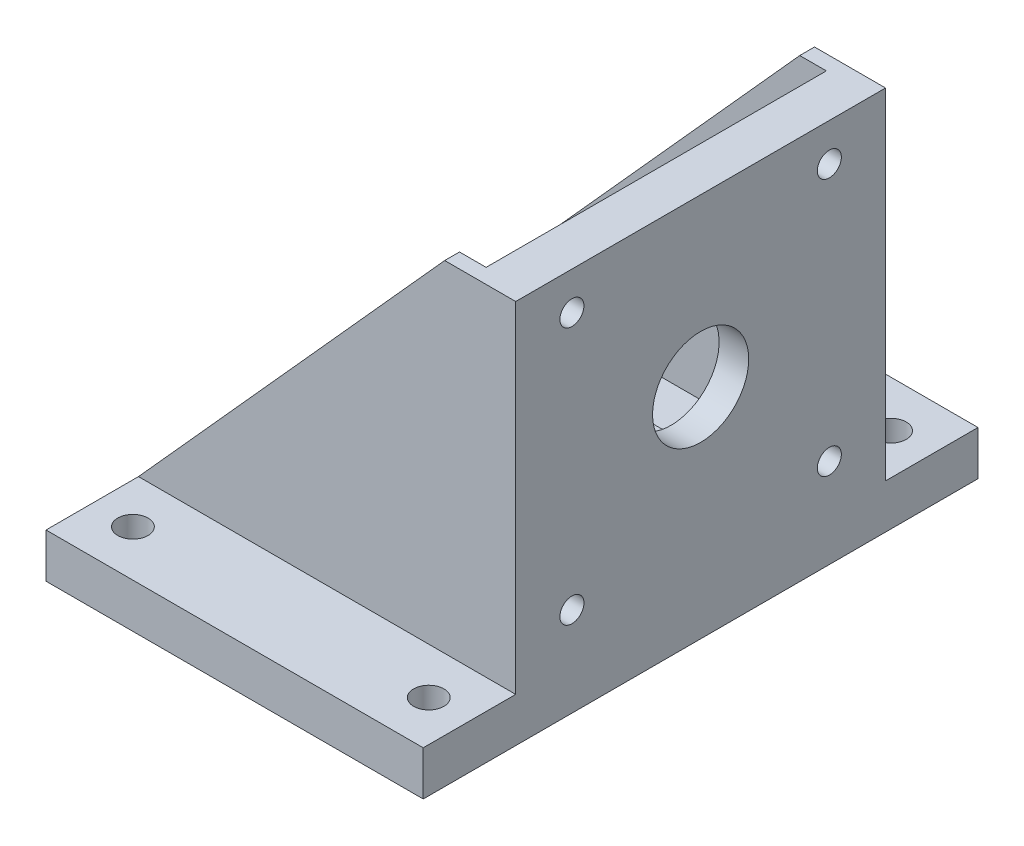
ISO-10303-21;
HEADER;
FILE_DESCRIPTION(('STEP AP214'),'2;1');
FILE_NAME('part.step','',(''),(''),'','','');
FILE_SCHEMA(('AUTOMOTIVE_DESIGN { 1 0 10303 214 1 1 1 1 }'));
ENDSEC;
DATA;
#1=APPLICATION_CONTEXT('core data for automotive mechanical design processes');
#2=APPLICATION_PROTOCOL_DEFINITION('international standard','automotive_design',2000,#1);
#3=PRODUCT_CONTEXT('',#1,'mechanical');
#4=PRODUCT('Part','Part','',(#3));
#5=PRODUCT_RELATED_PRODUCT_CATEGORY('part','',(#4));
#6=PRODUCT_DEFINITION_FORMATION('','',#4);
#7=PRODUCT_DEFINITION_CONTEXT('part definition',#1,'design');
#8=PRODUCT_DEFINITION('design','',#6,#7);
#9=PRODUCT_DEFINITION_SHAPE('','',#8);
#10=(LENGTH_UNIT() NAMED_UNIT(*) SI_UNIT(.MILLI.,.METRE.));
#11=(NAMED_UNIT(*) PLANE_ANGLE_UNIT() SI_UNIT($,.RADIAN.));
#12=(NAMED_UNIT(*) SI_UNIT($,.STERADIAN.) SOLID_ANGLE_UNIT());
#13=UNCERTAINTY_MEASURE_WITH_UNIT(LENGTH_MEASURE(1.E-05),#10,'distance_accuracy_value','');
#14=(GEOMETRIC_REPRESENTATION_CONTEXT(3) GLOBAL_UNCERTAINTY_ASSIGNED_CONTEXT((#13)) GLOBAL_UNIT_ASSIGNED_CONTEXT((#10,
#11,#12)) REPRESENTATION_CONTEXT('',''));
#15=CARTESIAN_POINT('',(0.,0.,0.));
#16=DIRECTION('',(0.,0.,1.));
#17=DIRECTION('',(1.,0.,0.));
#18=AXIS2_PLACEMENT_3D('',#15,#16,#17);
#19=CARTESIAN_POINT('',(0.,0.,0.));
#20=DIRECTION('',(1.,0.,0.));
#21=DIRECTION('',(0.,0.,-1.));
#22=AXIS2_PLACEMENT_3D('',#19,#20,#21);
#23=PLANE('',#22);
#24=CARTESIAN_POINT('',(0.,91.8000005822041,84.7999990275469));
#25=DIRECTION('',(1.,0.,0.));
#26=DIRECTION('',(0.,0.,-1.));
#27=AXIS2_PLACEMENT_3D('',#24,#25,#26);
#28=CIRCLE('',#27,3.2499986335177);
#29=CARTESIAN_POINT('',(0.,91.8000005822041,81.5500003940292));
#30=VERTEX_POINT('',#29);
#31=EDGE_CURVE('E312',#30,#30,#28,.T.);
#32=ORIENTED_EDGE('',*,*,#31,.T.);
#33=EDGE_LOOP('',(#32));
#34=FACE_BOUND('',#33,.T.);
#35=CARTESIAN_POINT('',(0.,91.7999975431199,15.20000165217));
#36=DIRECTION('',(1.,0.,0.));
#37=DIRECTION('',(0.,0.,-1.));
#38=AXIS2_PLACEMENT_3D('',#35,#36,#37);
#39=CIRCLE('',#38,3.25000278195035);
#40=CARTESIAN_POINT('',(0.,91.7999975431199,11.9499988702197));
#41=VERTEX_POINT('',#40);
#42=EDGE_CURVE('E306',#41,#41,#39,.T.);
#43=ORIENTED_EDGE('',*,*,#42,.T.);
#44=EDGE_LOOP('',(#43));
#45=FACE_BOUND('',#44,.T.);
#46=CARTESIAN_POINT('',(0.,22.2000021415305,15.1999995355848));
#47=DIRECTION('',(1.,0.,0.));
#48=DIRECTION('',(0.,0.,-1.));
#49=AXIS2_PLACEMENT_3D('',#46,#47,#48);
#50=CIRCLE('',#49,3.24999979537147);
#51=CARTESIAN_POINT('',(0.,22.2000021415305,11.9499997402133));
#52=VERTEX_POINT('',#51);
#53=EDGE_CURVE('E300',#52,#52,#50,.T.);
#54=ORIENTED_EDGE('',*,*,#53,.T.);
#55=EDGE_LOOP('',(#54));
#56=FACE_BOUND('',#55,.T.);
#57=CARTESIAN_POINT('',(0.,22.199999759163,84.800000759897));
#58=DIRECTION('',(1.,0.,0.));
#59=DIRECTION('',(0.,0.,-1.));
#60=AXIS2_PLACEMENT_3D('',#57,#58,#59);
#61=CIRCLE('',#60,3.249999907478);
#62=CARTESIAN_POINT('',(0.,22.199999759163,81.550000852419));
#63=VERTEX_POINT('',#62);
#64=EDGE_CURVE('E296',#63,#63,#61,.T.);
#65=ORIENTED_EDGE('',*,*,#64,.T.);
#66=EDGE_LOOP('',(#65));
#67=FACE_BOUND('',#66,.T.);
#68=CARTESIAN_POINT('',(0.,57.0000005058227,50.0000030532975));
#69=DIRECTION('',(-1.,0.,0.));
#70=DIRECTION('',(0.,0.,1.));
#71=AXIS2_PLACEMENT_3D('',#68,#69,#70);
#72=CIRCLE('',#71,41.);
#73=CARTESIAN_POINT('',(0.,57.0000005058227,91.0000030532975));
#74=VERTEX_POINT('',#73);
#75=EDGE_CURVE('E575',#74,#74,#72,.T.);
#76=ORIENTED_EDGE('',*,*,#75,.F.);
#77=EDGE_LOOP('',(#76));
#78=FACE_BOUND('',#77,.T.);
#79=DIRECTION('',(0.,0.,1.));
#80=VECTOR('',#79,1.);
#81=CARTESIAN_POINT('',(0.,101.999999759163,0.));
#82=LINE('',#81,#80);
#83=CARTESIAN_POINT('',(0.,101.999999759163,4.));
#84=VERTEX_POINT('',#83);
#85=CARTESIAN_POINT('',(0.,101.999999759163,96.));
#86=VERTEX_POINT('',#85);
#87=EDGE_CURVE('E717',#84,#86,#82,.T.);
#88=ORIENTED_EDGE('',*,*,#87,.F.);
#89=DIRECTION('',(0.,-1.,0.));
#90=VECTOR('',#89,1.);
#91=CARTESIAN_POINT('',(0.,0.,4.));
#92=LINE('',#91,#90);
#93=CARTESIAN_POINT('',(0.,7.99999999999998,4.));
#94=VERTEX_POINT('',#93);
#95=EDGE_CURVE('E247',#84,#94,#92,.T.);
#96=ORIENTED_EDGE('',*,*,#95,.T.);
#97=DIRECTION('',(0.,0.,-1.));
#98=VECTOR('',#97,1.);
#99=CARTESIAN_POINT('',(0.,7.99999999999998,4.));
#100=LINE('',#99,#98);
#101=CARTESIAN_POINT('',(0.,7.99999999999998,20.));
#102=VERTEX_POINT('',#101);
#103=EDGE_CURVE('E515',#102,#94,#100,.T.);
#104=ORIENTED_EDGE('',*,*,#103,.F.);
#105=DIRECTION('',(0.,-1.,0.));
#106=VECTOR('',#105,1.);
#107=CARTESIAN_POINT('',(0.,11.9,20.));
#108=LINE('',#107,#106);
#109=CARTESIAN_POINT('',(0.,11.9,20.));
#110=VERTEX_POINT('',#109);
#111=EDGE_CURVE('E256',#110,#102,#108,.T.);
#112=ORIENTED_EDGE('',*,*,#111,.F.);
#113=DIRECTION('',(0.,0.,-1.));
#114=VECTOR('',#113,1.);
#115=CARTESIAN_POINT('',(0.,11.9,20.));
#116=LINE('',#115,#114);
#117=CARTESIAN_POINT('',(0.,11.9,25.));
#118=VERTEX_POINT('',#117);
#119=EDGE_CURVE('E497',#118,#110,#116,.T.);
#120=ORIENTED_EDGE('',*,*,#119,.F.);
#121=DIRECTION('',(0.,-1.,0.));
#122=VECTOR('',#121,1.);
#123=CARTESIAN_POINT('',(0.,11.9,25.));
#124=LINE('',#123,#122);
#125=CARTESIAN_POINT('',(0.,7.99999999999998,25.));
#126=VERTEX_POINT('',#125);
#127=EDGE_CURVE('E504',#118,#126,#124,.T.);
#128=ORIENTED_EDGE('',*,*,#127,.T.);
#129=DIRECTION('',(0.,0.,-1.));
#130=VECTOR('',#129,1.);
#131=CARTESIAN_POINT('',(0.,7.99999999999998,25.));
#132=LINE('',#131,#130);
#133=CARTESIAN_POINT('',(0.,7.99999999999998,38.6));
#134=VERTEX_POINT('',#133);
#135=EDGE_CURVE('E501',#134,#126,#132,.T.);
#136=ORIENTED_EDGE('',*,*,#135,.F.);
#137=DIRECTION('',(0.,-1.,0.));
#138=VECTOR('',#137,1.);
#139=CARTESIAN_POINT('',(0.,11.9,38.6));
#140=LINE('',#139,#138);
#141=CARTESIAN_POINT('',(0.,11.9,38.6));
#142=VERTEX_POINT('',#141);
#143=EDGE_CURVE('E488',#142,#134,#140,.T.);
#144=ORIENTED_EDGE('',*,*,#143,.F.);
#145=DIRECTION('',(0.,0.,-1.));
#146=VECTOR('',#145,1.);
#147=CARTESIAN_POINT('',(0.,11.9,38.6));
#148=LINE('',#147,#146);
#149=CARTESIAN_POINT('',(0.,11.9,43.6));
#150=VERTEX_POINT('',#149);
#151=EDGE_CURVE('E613',#150,#142,#148,.T.);
#152=ORIENTED_EDGE('',*,*,#151,.F.);
#153=DIRECTION('',(0.,-1.,0.));
#154=VECTOR('',#153,1.);
#155=CARTESIAN_POINT('',(0.,11.9,43.6));
#156=LINE('',#155,#154);
#157=CARTESIAN_POINT('',(0.,7.99999999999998,43.6));
#158=VERTEX_POINT('',#157);
#159=EDGE_CURVE('E620',#150,#158,#156,.T.);
#160=ORIENTED_EDGE('',*,*,#159,.T.);
#161=DIRECTION('',(0.,0.,-1.));
#162=VECTOR('',#161,1.);
#163=CARTESIAN_POINT('',(0.,7.99999999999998,43.6));
#164=LINE('',#163,#162);
#165=CARTESIAN_POINT('',(0.,7.99999999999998,57.2));
#166=VERTEX_POINT('',#165);
#167=EDGE_CURVE('E523',#166,#158,#164,.T.);
#168=ORIENTED_EDGE('',*,*,#167,.F.);
#169=DIRECTION('',(0.,-1.,0.));
#170=VECTOR('',#169,1.);
#171=CARTESIAN_POINT('',(0.,11.9,57.2));
#172=LINE('',#171,#170);
#173=CARTESIAN_POINT('',(0.,11.9,57.2));
#174=VERTEX_POINT('',#173);
#175=EDGE_CURVE('E611',#174,#166,#172,.T.);
#176=ORIENTED_EDGE('',*,*,#175,.F.);
#177=DIRECTION('',(0.,0.,-1.));
#178=VECTOR('',#177,1.);
#179=CARTESIAN_POINT('',(0.,11.9,57.2));
#180=LINE('',#179,#178);
#181=CARTESIAN_POINT('',(0.,11.9,62.2));
#182=VERTEX_POINT('',#181);
#183=EDGE_CURVE('E596',#182,#174,#180,.T.);
#184=ORIENTED_EDGE('',*,*,#183,.F.);
#185=DIRECTION('',(0.,-1.,0.));
#186=VECTOR('',#185,1.);
#187=CARTESIAN_POINT('',(0.,11.9,62.2));
#188=LINE('',#187,#186);
#189=CARTESIAN_POINT('',(0.,7.99999999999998,62.2));
#190=VERTEX_POINT('',#189);
#191=EDGE_CURVE('E605',#182,#190,#188,.T.);
#192=ORIENTED_EDGE('',*,*,#191,.T.);
#193=DIRECTION('',(0.,0.,-1.));
#194=VECTOR('',#193,1.);
#195=CARTESIAN_POINT('',(0.,7.99999999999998,62.2));
#196=LINE('',#195,#194);
#197=CARTESIAN_POINT('',(0.,7.99999999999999,75.8));
#198=VERTEX_POINT('',#197);
#199=EDGE_CURVE('E536',#198,#190,#196,.T.);
#200=ORIENTED_EDGE('',*,*,#199,.F.);
#201=DIRECTION('',(0.,-1.,0.));
#202=VECTOR('',#201,1.);
#203=CARTESIAN_POINT('',(0.,11.9,75.8));
#204=LINE('',#203,#202);
#205=CARTESIAN_POINT('',(0.,11.9,75.8));
#206=VERTEX_POINT('',#205);
#207=EDGE_CURVE('E594',#206,#198,#204,.T.);
#208=ORIENTED_EDGE('',*,*,#207,.F.);
#209=DIRECTION('',(0.,0.,-1.));
#210=VECTOR('',#209,1.);
#211=CARTESIAN_POINT('',(0.,11.9,75.8));
#212=LINE('',#211,#210);
#213=CARTESIAN_POINT('',(0.,11.9,80.8));
#214=VERTEX_POINT('',#213);
#215=EDGE_CURVE('E335',#214,#206,#212,.T.);
#216=ORIENTED_EDGE('',*,*,#215,.F.);
#217=DIRECTION('',(0.,-1.,0.));
#218=VECTOR('',#217,1.);
#219=CARTESIAN_POINT('',(0.,11.9,80.8));
#220=LINE('',#219,#218);
#221=CARTESIAN_POINT('',(0.,7.99999999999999,80.8));
#222=VERTEX_POINT('',#221);
#223=EDGE_CURVE('E588',#214,#222,#220,.T.);
#224=ORIENTED_EDGE('',*,*,#223,.T.);
#225=DIRECTION('',(0.,0.,-1.));
#226=VECTOR('',#225,1.);
#227=CARTESIAN_POINT('',(0.,7.99999999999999,96.));
#228=LINE('',#227,#226);
#229=CARTESIAN_POINT('',(0.,7.99999999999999,96.));
#230=VERTEX_POINT('',#229);
#231=EDGE_CURVE('E548',#230,#222,#228,.T.);
#232=ORIENTED_EDGE('',*,*,#231,.F.);
#233=DIRECTION('',(0.,-1.,0.));
#234=VECTOR('',#233,1.);
#235=CARTESIAN_POINT('',(0.,0.,96.));
#236=LINE('',#235,#234);
#237=EDGE_CURVE('E269',#86,#230,#236,.T.);
#238=ORIENTED_EDGE('',*,*,#237,.F.);
#239=EDGE_LOOP('',(#88,#96,#104,#112,#120,#128,#136,#144,#152,#160,#168,#176,#184,#192,#200,
#208,#216,#224,#232,#238));
#240=FACE_BOUND('',#239,.T.);
#241=ADVANCED_FACE('F40',(#34,#45,#56,#67,#78,#240),#23,.F.);
#242=CARTESIAN_POINT('',(12.,0.,0.));
#243=DIRECTION('',(1.,0.,0.));
#244=DIRECTION('',(0.,0.,-1.));
#245=AXIS2_PLACEMENT_3D('',#242,#243,#244);
#246=PLANE('',#245);
#247=CARTESIAN_POINT('',(12.,22.2000021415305,15.1999995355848));
#248=DIRECTION('',(1.,0.,0.));
#249=DIRECTION('',(0.,0.,-1.));
#250=AXIS2_PLACEMENT_3D('',#247,#248,#249);
#251=CIRCLE('',#250,3.24999979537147);
#252=CARTESIAN_POINT('',(12.,22.2000021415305,11.9499997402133));
#253=VERTEX_POINT('',#252);
#254=EDGE_CURVE('E303',#253,#253,#251,.T.);
#255=ORIENTED_EDGE('',*,*,#254,.F.);
#256=EDGE_LOOP('',(#255));
#257=FACE_BOUND('',#256,.T.);
#258=CARTESIAN_POINT('',(12.,91.8000005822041,84.7999990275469));
#259=DIRECTION('',(1.,0.,0.));
#260=DIRECTION('',(0.,0.,-1.));
#261=AXIS2_PLACEMENT_3D('',#258,#259,#260);
#262=CIRCLE('',#261,3.2499986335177);
#263=CARTESIAN_POINT('',(12.,91.8000005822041,81.5500003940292));
#264=VERTEX_POINT('',#263);
#265=EDGE_CURVE('E315',#264,#264,#262,.T.);
#266=ORIENTED_EDGE('',*,*,#265,.F.);
#267=EDGE_LOOP('',(#266));
#268=FACE_BOUND('',#267,.T.);
#269=CARTESIAN_POINT('',(12.,57.0000005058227,50.0000030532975));
#270=DIRECTION('',(1.,0.,0.));
#271=DIRECTION('',(0.,0.,-1.));
#272=AXIS2_PLACEMENT_3D('',#269,#270,#271);
#273=CIRCLE('',#272,13.);
#274=CARTESIAN_POINT('',(12.,57.0000005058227,37.0000030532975));
#275=VERTEX_POINT('',#274);
#276=EDGE_CURVE('E318',#275,#275,#273,.T.);
#277=ORIENTED_EDGE('',*,*,#276,.F.);
#278=EDGE_LOOP('',(#277));
#279=FACE_BOUND('',#278,.T.);
#280=CARTESIAN_POINT('',(12.,91.7999975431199,15.20000165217));
#281=DIRECTION('',(1.,0.,0.));
#282=DIRECTION('',(0.,0.,-1.));
#283=AXIS2_PLACEMENT_3D('',#280,#281,#282);
#284=CIRCLE('',#283,3.25000278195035);
#285=CARTESIAN_POINT('',(12.,91.7999975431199,11.9499988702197));
#286=VERTEX_POINT('',#285);
#287=EDGE_CURVE('E309',#286,#286,#284,.T.);
#288=ORIENTED_EDGE('',*,*,#287,.F.);
#289=EDGE_LOOP('',(#288));
#290=FACE_BOUND('',#289,.T.);
#291=CARTESIAN_POINT('',(12.,22.199999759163,84.800000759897));
#292=DIRECTION('',(1.,0.,0.));
#293=DIRECTION('',(0.,0.,-1.));
#294=AXIS2_PLACEMENT_3D('',#291,#292,#293);
#295=CIRCLE('',#294,3.249999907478);
#296=CARTESIAN_POINT('',(12.,22.199999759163,81.550000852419));
#297=VERTEX_POINT('',#296);
#298=EDGE_CURVE('E297',#297,#297,#295,.T.);
#299=ORIENTED_EDGE('',*,*,#298,.F.);
#300=EDGE_LOOP('',(#299));
#301=FACE_BOUND('',#300,.T.);
#302=DIRECTION('',(0.,1.,0.));
#303=VECTOR('',#302,1.);
#304=CARTESIAN_POINT('',(12.,0.,0.));
#305=LINE('',#304,#303);
#306=CARTESIAN_POINT('',(12.,9.99999999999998,0.));
#307=VERTEX_POINT('',#306);
#308=CARTESIAN_POINT('',(12.,101.999999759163,0.));
#309=VERTEX_POINT('',#308);
#310=EDGE_CURVE('E323',#307,#309,#305,.T.);
#311=ORIENTED_EDGE('',*,*,#310,.T.);
#312=DIRECTION('',(0.,0.,1.));
#313=VECTOR('',#312,1.);
#314=CARTESIAN_POINT('',(12.,101.999999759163,0.));
#315=LINE('',#314,#313);
#316=CARTESIAN_POINT('',(12.,101.999999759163,100.));
#317=VERTEX_POINT('',#316);
#318=EDGE_CURVE('E720',#309,#317,#315,.T.);
#319=ORIENTED_EDGE('',*,*,#318,.T.);
#320=DIRECTION('',(0.,-1.,0.));
#321=VECTOR('',#320,1.);
#322=CARTESIAN_POINT('',(12.,0.,100.));
#323=LINE('',#322,#321);
#324=CARTESIAN_POINT('',(12.,9.99999999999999,100.));
#325=VERTEX_POINT('',#324);
#326=EDGE_CURVE('E326',#317,#325,#323,.T.);
#327=ORIENTED_EDGE('',*,*,#326,.T.);
#328=DIRECTION('',(0.,0.,-1.));
#329=VECTOR('',#328,1.);
#330=CARTESIAN_POINT('',(12.,9.99999999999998,-25.));
#331=LINE('',#330,#329);
#332=CARTESIAN_POINT('',(12.,9.99999999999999,125.));
#333=VERTEX_POINT('',#332);
#334=EDGE_CURVE('E285',#333,#325,#331,.T.);
#335=ORIENTED_EDGE('',*,*,#334,.F.);
#336=DIRECTION('',(0.,1.,0.));
#337=VECTOR('',#336,1.);
#338=CARTESIAN_POINT('',(12.,9.99999999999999,125.));
#339=LINE('',#338,#337);
#340=CARTESIAN_POINT('',(12.,-2.,125.));
#341=VERTEX_POINT('',#340);
#342=EDGE_CURVE('E280',#341,#333,#339,.T.);
#343=ORIENTED_EDGE('',*,*,#342,.F.);
#344=DIRECTION('',(0.,0.,1.));
#345=VECTOR('',#344,1.);
#346=CARTESIAN_POINT('',(12.,-2.,-25.));
#347=LINE('',#346,#345);
#348=CARTESIAN_POINT('',(12.,-2.,-25.));
#349=VERTEX_POINT('',#348);
#350=EDGE_CURVE('E569',#349,#341,#347,.T.);
#351=ORIENTED_EDGE('',*,*,#350,.F.);
#352=DIRECTION('',(0.,-1.,0.));
#353=VECTOR('',#352,1.);
#354=CARTESIAN_POINT('',(12.,9.99999999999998,-25.));
#355=LINE('',#354,#353);
#356=CARTESIAN_POINT('',(12.,9.99999999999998,-25.));
#357=VERTEX_POINT('',#356);
#358=EDGE_CURVE('E281',#357,#349,#355,.T.);
#359=ORIENTED_EDGE('',*,*,#358,.F.);
#360=EDGE_CURVE('E288',#307,#357,#331,.T.);
#361=ORIENTED_EDGE('',*,*,#360,.F.);
#362=EDGE_LOOP('',(#311,#319,#327,#335,#343,#351,#359,#361));
#363=FACE_BOUND('',#362,.T.);
#364=ADVANCED_FACE('F407',(#257,#268,#279,#290,#301,#363),#246,.T.);
#365=CARTESIAN_POINT('',(12.,0.,0.));
#366=DIRECTION('',(0.,0.,1.));
#367=DIRECTION('',(1.,0.,0.));
#368=AXIS2_PLACEMENT_3D('',#365,#366,#367);
#369=PLANE('',#368);
#370=DIRECTION('',(-1.,0.,0.));
#371=VECTOR('',#370,1.);
#372=CARTESIAN_POINT('',(12.,101.999999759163,0.));
#373=LINE('',#372,#371);
#374=CARTESIAN_POINT('',(-7.20000021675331,101.999999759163,0.));
#375=VERTEX_POINT('',#374);
#376=EDGE_CURVE('E56',#309,#375,#373,.T.);
#377=ORIENTED_EDGE('',*,*,#376,.F.);
#378=ORIENTED_EDGE('',*,*,#310,.F.);
#379=DIRECTION('',(-1.,0.,0.));
#380=VECTOR('',#379,1.);
#381=CARTESIAN_POINT('',(12.,9.99999999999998,0.));
#382=LINE('',#381,#380);
#383=CARTESIAN_POINT('',(-90.,9.99999999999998,0.));
#384=VERTEX_POINT('',#383);
#385=EDGE_CURVE('E283',#307,#384,#382,.T.);
#386=ORIENTED_EDGE('',*,*,#385,.T.);
#387=DIRECTION('',(0.66896473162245,0.743294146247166,0.));
#388=VECTOR('',#387,1.);
#389=CARTESIAN_POINT('',(0.,110.,0.));
#390=LINE('',#389,#388);
#391=EDGE_CURVE('E253',#384,#375,#390,.T.);
#392=ORIENTED_EDGE('',*,*,#391,.T.);
#393=EDGE_LOOP('',(#377,#378,#386,#392));
#394=FACE_BOUND('',#393,.T.);
#395=ADVANCED_FACE('F403',(#394),#369,.F.);
#396=CARTESIAN_POINT('',(12.,0.,100.));
#397=DIRECTION('',(0.,0.,-1.));
#398=DIRECTION('',(-1.,0.,0.));
#399=AXIS2_PLACEMENT_3D('',#396,#397,#398);
#400=PLANE('',#399);
#401=DIRECTION('',(1.,0.,0.));
#402=VECTOR('',#401,1.);
#403=CARTESIAN_POINT('',(12.,101.999999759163,100.));
#404=LINE('',#403,#402);
#405=CARTESIAN_POINT('',(-7.20000021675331,101.999999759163,100.));
#406=VERTEX_POINT('',#405);
#407=EDGE_CURVE('E716',#406,#317,#404,.T.);
#408=ORIENTED_EDGE('',*,*,#407,.F.);
#409=DIRECTION('',(-0.66896473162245,-0.743294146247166,0.));
#410=VECTOR('',#409,1.);
#411=CARTESIAN_POINT('',(0.,110.,100.));
#412=LINE('',#411,#410);
#413=CARTESIAN_POINT('',(-90.,9.99999999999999,100.));
#414=VERTEX_POINT('',#413);
#415=EDGE_CURVE('E262',#406,#414,#412,.T.);
#416=ORIENTED_EDGE('',*,*,#415,.T.);
#417=DIRECTION('',(1.,0.,0.));
#418=VECTOR('',#417,1.);
#419=CARTESIAN_POINT('',(12.,9.99999999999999,100.));
#420=LINE('',#419,#418);
#421=EDGE_CURVE('E328',#414,#325,#420,.T.);
#422=ORIENTED_EDGE('',*,*,#421,.T.);
#423=ORIENTED_EDGE('',*,*,#326,.F.);
#424=EDGE_LOOP('',(#408,#416,#422,#423));
#425=FACE_BOUND('',#424,.T.);
#426=ADVANCED_FACE('F406',(#425),#400,.F.);
#427=CARTESIAN_POINT('',(0.,0.,96.));
#428=DIRECTION('',(0.,0.,1.));
#429=DIRECTION('',(1.,0.,0.));
#430=AXIS2_PLACEMENT_3D('',#427,#428,#429);
#431=PLANE('',#430);
#432=DIRECTION('',(-1.,0.,0.));
#433=VECTOR('',#432,1.);
#434=CARTESIAN_POINT('',(0.,101.999999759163,96.));
#435=LINE('',#434,#433);
#436=CARTESIAN_POINT('',(-7.20000021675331,101.999999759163,96.));
#437=VERTEX_POINT('',#436);
#438=EDGE_CURVE('E715',#86,#437,#435,.T.);
#439=ORIENTED_EDGE('',*,*,#438,.F.);
#440=ORIENTED_EDGE('',*,*,#237,.T.);
#441=DIRECTION('',(1.,0.,0.));
#442=VECTOR('',#441,1.);
#443=CARTESIAN_POINT('',(0.,7.99999999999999,96.));
#444=LINE('',#443,#442);
#445=CARTESIAN_POINT('',(-90.,7.99999999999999,96.));
#446=VERTEX_POINT('',#445);
#447=EDGE_CURVE('E557',#446,#230,#444,.T.);
#448=ORIENTED_EDGE('',*,*,#447,.F.);
#449=DIRECTION('',(0.,1.,0.));
#450=VECTOR('',#449,1.);
#451=CARTESIAN_POINT('',(-90.,7.99999999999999,96.));
#452=LINE('',#451,#450);
#453=CARTESIAN_POINT('',(-90.,9.99999999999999,96.));
#454=VERTEX_POINT('',#453);
#455=EDGE_CURVE('E540',#446,#454,#452,.T.);
#456=ORIENTED_EDGE('',*,*,#455,.T.);
#457=DIRECTION('',(-0.66896473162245,-0.743294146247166,0.));
#458=VECTOR('',#457,1.);
#459=CARTESIAN_POINT('',(0.,110.,96.));
#460=LINE('',#459,#458);
#461=EDGE_CURVE('E263',#437,#454,#460,.T.);
#462=ORIENTED_EDGE('',*,*,#461,.F.);
#463=EDGE_LOOP('',(#439,#440,#448,#456,#462));
#464=FACE_BOUND('',#463,.T.);
#465=ADVANCED_FACE('F411',(#464),#431,.F.);
#466=CARTESIAN_POINT('',(0.,110.,96.));
#467=DIRECTION('',(-0.743294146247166,0.66896473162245,0.));
#468=DIRECTION('',(-0.66896473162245,-0.743294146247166,0.));
#469=AXIS2_PLACEMENT_3D('',#466,#467,#468);
#470=PLANE('',#469);
#471=ORIENTED_EDGE('',*,*,#415,.F.);
#472=DIRECTION('',(0.,0.,-1.));
#473=VECTOR('',#472,1.);
#474=CARTESIAN_POINT('',(-7.20000021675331,101.999999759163,96.));
#475=LINE('',#474,#473);
#476=EDGE_CURVE('E714',#406,#437,#475,.T.);
#477=ORIENTED_EDGE('',*,*,#476,.T.);
#478=ORIENTED_EDGE('',*,*,#461,.T.);
#479=DIRECTION('',(0.,0.,1.));
#480=VECTOR('',#479,1.);
#481=CARTESIAN_POINT('',(-90.,9.99999999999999,96.));
#482=LINE('',#481,#480);
#483=EDGE_CURVE('E265',#454,#414,#482,.T.);
#484=ORIENTED_EDGE('',*,*,#483,.T.);
#485=EDGE_LOOP('',(#471,#477,#478,#484));
#486=FACE_BOUND('',#485,.T.);
#487=ADVANCED_FACE('F457',(#486),#470,.T.);
#488=CARTESIAN_POINT('',(0.,0.,4.));
#489=DIRECTION('',(0.,0.,1.));
#490=DIRECTION('',(1.,0.,0.));
#491=AXIS2_PLACEMENT_3D('',#488,#489,#490);
#492=PLANE('',#491);
#493=ORIENTED_EDGE('',*,*,#95,.F.);
#494=DIRECTION('',(-1.,0.,0.));
#495=VECTOR('',#494,1.);
#496=CARTESIAN_POINT('',(0.,101.999999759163,4.));
#497=LINE('',#496,#495);
#498=CARTESIAN_POINT('',(-7.20000021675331,101.999999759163,4.));
#499=VERTEX_POINT('',#498);
#500=EDGE_CURVE('E235',#84,#499,#497,.T.);
#501=ORIENTED_EDGE('',*,*,#500,.T.);
#502=DIRECTION('',(0.66896473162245,0.743294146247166,0.));
#503=VECTOR('',#502,1.);
#504=CARTESIAN_POINT('',(0.,110.,4.));
#505=LINE('',#504,#503);
#506=CARTESIAN_POINT('',(-90.,9.99999999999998,4.));
#507=VERTEX_POINT('',#506);
#508=EDGE_CURVE('E245',#507,#499,#505,.T.);
#509=ORIENTED_EDGE('',*,*,#508,.F.);
#510=DIRECTION('',(0.,1.,0.));
#511=VECTOR('',#510,1.);
#512=CARTESIAN_POINT('',(-90.,7.99999999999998,4.));
#513=LINE('',#512,#511);
#514=CARTESIAN_POINT('',(-90.,7.99999999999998,4.));
#515=VERTEX_POINT('',#514);
#516=EDGE_CURVE('E566',#515,#507,#513,.T.);
#517=ORIENTED_EDGE('',*,*,#516,.F.);
#518=DIRECTION('',(-1.,0.,0.));
#519=VECTOR('',#518,1.);
#520=CARTESIAN_POINT('',(0.,7.99999999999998,4.));
#521=LINE('',#520,#519);
#522=EDGE_CURVE('E518',#94,#515,#521,.T.);
#523=ORIENTED_EDGE('',*,*,#522,.F.);
#524=EDGE_LOOP('',(#493,#501,#509,#517,#523));
#525=FACE_BOUND('',#524,.T.);
#526=ADVANCED_FACE('F244',(#525),#492,.T.);
#527=CARTESIAN_POINT('',(0.,110.,4.));
#528=DIRECTION('',(-0.743294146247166,0.66896473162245,0.));
#529=DIRECTION('',(-0.66896473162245,-0.743294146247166,0.));
#530=AXIS2_PLACEMENT_3D('',#527,#528,#529);
#531=PLANE('',#530);
#532=ORIENTED_EDGE('',*,*,#508,.T.);
#533=DIRECTION('',(0.,0.,-1.));
#534=VECTOR('',#533,1.);
#535=CARTESIAN_POINT('',(-7.20000021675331,101.999999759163,4.));
#536=LINE('',#535,#534);
#537=EDGE_CURVE('E12',#499,#375,#536,.T.);
#538=ORIENTED_EDGE('',*,*,#537,.T.);
#539=ORIENTED_EDGE('',*,*,#391,.F.);
#540=DIRECTION('',(0.,0.,-1.));
#541=VECTOR('',#540,1.);
#542=CARTESIAN_POINT('',(-90.,9.99999999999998,4.));
#543=LINE('',#542,#541);
#544=EDGE_CURVE('E252',#507,#384,#543,.T.);
#545=ORIENTED_EDGE('',*,*,#544,.F.);
#546=EDGE_LOOP('',(#532,#538,#539,#545));
#547=FACE_BOUND('',#546,.T.);
#548=ADVANCED_FACE('F250',(#547),#531,.T.);
#549=CARTESIAN_POINT('',(12.,57.0000005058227,50.0000030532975));
#550=DIRECTION('',(-1.,0.,0.));
#551=DIRECTION('',(0.,0.,1.));
#552=AXIS2_PLACEMENT_3D('',#549,#550,#551);
#553=CYLINDRICAL_SURFACE('',#552,13.);
#554=ORIENTED_EDGE('',*,*,#276,.T.);
#555=EDGE_LOOP('',(#554));
#556=FACE_BOUND('',#555,.T.);
#557=CARTESIAN_POINT('',(4.,57.0000005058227,50.0000030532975));
#558=DIRECTION('',(-1.,0.,0.));
#559=DIRECTION('',(0.,0.,1.));
#560=AXIS2_PLACEMENT_3D('',#557,#558,#559);
#561=CIRCLE('',#560,13.);
#562=CARTESIAN_POINT('',(4.,57.0000005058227,63.0000030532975));
#563=VERTEX_POINT('',#562);
#564=EDGE_CURVE('E332',#563,#563,#561,.T.);
#565=ORIENTED_EDGE('',*,*,#564,.T.);
#566=EDGE_LOOP('',(#565));
#567=FACE_BOUND('',#566,.T.);
#568=ADVANCED_FACE('F419',(#556,#567),#553,.F.);
#569=CARTESIAN_POINT('',(162.332963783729,9.99999999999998,-25.));
#570=DIRECTION('',(0.,1.,0.));
#571=DIRECTION('',(0.,0.,1.));
#572=AXIS2_PLACEMENT_3D('',#569,#570,#571);
#573=PLANE('',#572);
#574=CARTESIAN_POINT('',(-79.,9.99999999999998,-12.5));
#575=DIRECTION('',(0.,1.,0.));
#576=DIRECTION('',(0.,0.,1.));
#577=AXIS2_PLACEMENT_3D('',#574,#575,#576);
#578=CIRCLE('',#577,4.09999999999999);
#579=CARTESIAN_POINT('',(-79.,9.99999999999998,-8.40000000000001));
#580=VERTEX_POINT('',#579);
#581=EDGE_CURVE('E730',#580,#580,#578,.T.);
#582=ORIENTED_EDGE('',*,*,#581,.F.);
#583=EDGE_LOOP('',(#582));
#584=FACE_BOUND('',#583,.T.);
#585=CARTESIAN_POINT('',(1.,9.99999999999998,-12.5));
#586=DIRECTION('',(0.,1.,0.));
#587=DIRECTION('',(0.,0.,1.));
#588=AXIS2_PLACEMENT_3D('',#585,#586,#587);
#589=CIRCLE('',#588,4.1);
#590=CARTESIAN_POINT('',(1.,9.99999999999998,-8.4));
#591=VERTEX_POINT('',#590);
#592=EDGE_CURVE('E729',#591,#591,#589,.T.);
#593=ORIENTED_EDGE('',*,*,#592,.F.);
#594=EDGE_LOOP('',(#593));
#595=FACE_BOUND('',#594,.T.);
#596=DIRECTION('',(0.,0.,-1.));
#597=VECTOR('',#596,1.);
#598=CARTESIAN_POINT('',(-90.,9.99999999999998,-25.));
#599=LINE('',#598,#597);
#600=CARTESIAN_POINT('',(-90.,9.99999999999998,-25.));
#601=VERTEX_POINT('',#600);
#602=EDGE_CURVE('E276',#384,#601,#599,.T.);
#603=ORIENTED_EDGE('',*,*,#602,.F.);
#604=ORIENTED_EDGE('',*,*,#385,.F.);
#605=ORIENTED_EDGE('',*,*,#360,.T.);
#606=DIRECTION('',(-1.,0.,0.));
#607=VECTOR('',#606,1.);
#608=CARTESIAN_POINT('',(162.332963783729,9.99999999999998,-25.));
#609=LINE('',#608,#607);
#610=EDGE_CURVE('E284',#357,#601,#609,.T.);
#611=ORIENTED_EDGE('',*,*,#610,.T.);
#612=EDGE_LOOP('',(#603,#604,#605,#611));
#613=FACE_BOUND('',#612,.T.);
#614=ADVANCED_FACE('F422',(#584,#595,#613),#573,.T.);
#615=CARTESIAN_POINT('',(12.,91.8000005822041,84.7999990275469));
#616=DIRECTION('',(-1.,0.,0.));
#617=DIRECTION('',(0.,0.,1.));
#618=AXIS2_PLACEMENT_3D('',#615,#616,#617);
#619=CYLINDRICAL_SURFACE('',#618,3.2499986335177);
#620=ORIENTED_EDGE('',*,*,#265,.T.);
#621=EDGE_LOOP('',(#620));
#622=FACE_BOUND('',#621,.T.);
#623=ORIENTED_EDGE('',*,*,#31,.F.);
#624=EDGE_LOOP('',(#623));
#625=FACE_BOUND('',#624,.T.);
#626=ADVANCED_FACE('F424',(#622,#625),#619,.F.);
#627=CARTESIAN_POINT('',(12.,91.7999975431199,15.20000165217));
#628=DIRECTION('',(-1.,0.,0.));
#629=DIRECTION('',(0.,0.,1.));
#630=AXIS2_PLACEMENT_3D('',#627,#628,#629);
#631=CYLINDRICAL_SURFACE('',#630,3.25000278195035);
#632=ORIENTED_EDGE('',*,*,#287,.T.);
#633=EDGE_LOOP('',(#632));
#634=FACE_BOUND('',#633,.T.);
#635=ORIENTED_EDGE('',*,*,#42,.F.);
#636=EDGE_LOOP('',(#635));
#637=FACE_BOUND('',#636,.T.);
#638=ADVANCED_FACE('F427',(#634,#637),#631,.F.);
#639=CARTESIAN_POINT('',(12.,22.2000021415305,15.1999995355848));
#640=DIRECTION('',(-1.,0.,0.));
#641=DIRECTION('',(0.,0.,1.));
#642=AXIS2_PLACEMENT_3D('',#639,#640,#641);
#643=CYLINDRICAL_SURFACE('',#642,3.24999979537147);
#644=ORIENTED_EDGE('',*,*,#254,.T.);
#645=EDGE_LOOP('',(#644));
#646=FACE_BOUND('',#645,.T.);
#647=ORIENTED_EDGE('',*,*,#53,.F.);
#648=EDGE_LOOP('',(#647));
#649=FACE_BOUND('',#648,.T.);
#650=ADVANCED_FACE('F431',(#646,#649),#643,.F.);
#651=CARTESIAN_POINT('',(12.,22.199999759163,84.800000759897));
#652=DIRECTION('',(-1.,0.,0.));
#653=DIRECTION('',(0.,0.,1.));
#654=AXIS2_PLACEMENT_3D('',#651,#652,#653);
#655=CYLINDRICAL_SURFACE('',#654,3.249999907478);
#656=ORIENTED_EDGE('',*,*,#298,.T.);
#657=EDGE_LOOP('',(#656));
#658=FACE_BOUND('',#657,.T.);
#659=ORIENTED_EDGE('',*,*,#64,.F.);
#660=EDGE_LOOP('',(#659));
#661=FACE_BOUND('',#660,.T.);
#662=ADVANCED_FACE('F435',(#658,#661),#655,.F.);
#663=CARTESIAN_POINT('',(1.,9.99999999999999,112.5));
#664=DIRECTION('',(0.,1.,0.));
#665=DIRECTION('',(0.,0.,1.));
#666=AXIS2_PLACEMENT_3D('',#663,#664,#665);
#667=CIRCLE('',#666,4.1);
#668=CARTESIAN_POINT('',(1.,9.99999999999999,116.6));
#669=VERTEX_POINT('',#668);
#670=EDGE_CURVE('E725',#669,#669,#667,.T.);
#671=ORIENTED_EDGE('',*,*,#670,.F.);
#672=EDGE_LOOP('',(#671));
#673=FACE_BOUND('',#672,.T.);
#674=CARTESIAN_POINT('',(-79.,9.99999999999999,112.5));
#675=DIRECTION('',(0.,1.,0.));
#676=DIRECTION('',(0.,0.,1.));
#677=AXIS2_PLACEMENT_3D('',#674,#675,#676);
#678=CIRCLE('',#677,4.09999999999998);
#679=CARTESIAN_POINT('',(-79.,9.99999999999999,116.6));
#680=VERTEX_POINT('',#679);
#681=EDGE_CURVE('E736',#680,#680,#678,.T.);
#682=ORIENTED_EDGE('',*,*,#681,.F.);
#683=EDGE_LOOP('',(#682));
#684=FACE_BOUND('',#683,.T.);
#685=ORIENTED_EDGE('',*,*,#421,.F.);
#686=CARTESIAN_POINT('',(-90.,9.99999999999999,125.));
#687=VERTEX_POINT('',#686);
#688=EDGE_CURVE('E277',#687,#414,#599,.T.);
#689=ORIENTED_EDGE('',*,*,#688,.F.);
#690=DIRECTION('',(-1.,0.,0.));
#691=VECTOR('',#690,1.);
#692=CARTESIAN_POINT('',(162.332963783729,9.99999999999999,125.));
#693=LINE('',#692,#691);
#694=EDGE_CURVE('E291',#333,#687,#693,.T.);
#695=ORIENTED_EDGE('',*,*,#694,.F.);
#696=ORIENTED_EDGE('',*,*,#334,.T.);
#697=EDGE_LOOP('',(#685,#689,#695,#696));
#698=FACE_BOUND('',#697,.T.);
#699=ADVANCED_FACE('F439',(#673,#684,#698),#573,.T.);
#700=CARTESIAN_POINT('',(162.332963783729,9.99999999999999,125.));
#701=DIRECTION('',(0.,0.,1.));
#702=DIRECTION('',(1.,0.,0.));
#703=AXIS2_PLACEMENT_3D('',#700,#701,#702);
#704=PLANE('',#703);
#705=DIRECTION('',(0.,1.,0.));
#706=VECTOR('',#705,1.);
#707=CARTESIAN_POINT('',(-90.,9.99999999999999,125.));
#708=LINE('',#707,#706);
#709=CARTESIAN_POINT('',(-90.,-2.,125.));
#710=VERTEX_POINT('',#709);
#711=EDGE_CURVE('E273',#710,#687,#708,.T.);
#712=ORIENTED_EDGE('',*,*,#711,.F.);
#713=DIRECTION('',(-1.,0.,0.));
#714=VECTOR('',#713,1.);
#715=CARTESIAN_POINT('',(-90.,-2.,125.));
#716=LINE('',#715,#714);
#717=EDGE_CURVE('E572',#341,#710,#716,.T.);
#718=ORIENTED_EDGE('',*,*,#717,.F.);
#719=ORIENTED_EDGE('',*,*,#342,.T.);
#720=ORIENTED_EDGE('',*,*,#694,.T.);
#721=EDGE_LOOP('',(#712,#718,#719,#720));
#722=FACE_BOUND('',#721,.T.);
#723=ADVANCED_FACE('F441',(#722),#704,.T.);
#724=CARTESIAN_POINT('',(162.332963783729,9.99999999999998,-25.));
#725=DIRECTION('',(0.,0.,-1.));
#726=DIRECTION('',(-1.,0.,0.));
#727=AXIS2_PLACEMENT_3D('',#724,#725,#726);
#728=PLANE('',#727);
#729=ORIENTED_EDGE('',*,*,#610,.F.);
#730=ORIENTED_EDGE('',*,*,#358,.T.);
#731=DIRECTION('',(1.,0.,0.));
#732=VECTOR('',#731,1.);
#733=CARTESIAN_POINT('',(-90.,-2.,-25.));
#734=LINE('',#733,#732);
#735=CARTESIAN_POINT('',(-90.,-2.,-25.));
#736=VERTEX_POINT('',#735);
#737=EDGE_CURVE('E565',#736,#349,#734,.T.);
#738=ORIENTED_EDGE('',*,*,#737,.F.);
#739=DIRECTION('',(0.,-1.,0.));
#740=VECTOR('',#739,1.);
#741=CARTESIAN_POINT('',(-90.,9.99999999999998,-25.));
#742=LINE('',#741,#740);
#743=EDGE_CURVE('E271',#601,#736,#742,.T.);
#744=ORIENTED_EDGE('',*,*,#743,.F.);
#745=EDGE_LOOP('',(#729,#730,#738,#744));
#746=FACE_BOUND('',#745,.T.);
#747=ADVANCED_FACE('F444',(#746),#728,.T.);
#748=CARTESIAN_POINT('',(-90.,0.,0.));
#749=DIRECTION('',(-1.,0.,0.));
#750=DIRECTION('',(0.,0.,1.));
#751=AXIS2_PLACEMENT_3D('',#748,#749,#750);
#752=PLANE('',#751);
#753=DIRECTION('',(0.,-1.,0.));
#754=VECTOR('',#753,1.);
#755=CARTESIAN_POINT('',(-90.,11.9,20.));
#756=LINE('',#755,#754);
#757=CARTESIAN_POINT('',(-90.,11.9,20.));
#758=VERTEX_POINT('',#757);
#759=CARTESIAN_POINT('',(-90.,7.99999999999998,20.));
#760=VERTEX_POINT('',#759);
#761=EDGE_CURVE('E636',#758,#760,#756,.T.);
#762=ORIENTED_EDGE('',*,*,#761,.T.);
#763=DIRECTION('',(0.,0.,1.));
#764=VECTOR('',#763,1.);
#765=CARTESIAN_POINT('',(-90.,7.99999999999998,4.));
#766=LINE('',#765,#764);
#767=EDGE_CURVE('E649',#515,#760,#766,.T.);
#768=ORIENTED_EDGE('',*,*,#767,.F.);
#769=ORIENTED_EDGE('',*,*,#516,.T.);
#770=ORIENTED_EDGE('',*,*,#544,.T.);
#771=ORIENTED_EDGE('',*,*,#602,.T.);
#772=ORIENTED_EDGE('',*,*,#743,.T.);
#773=DIRECTION('',(0.,0.,-1.));
#774=VECTOR('',#773,1.);
#775=CARTESIAN_POINT('',(-90.,-2.,-25.));
#776=LINE('',#775,#774);
#777=EDGE_CURVE('E562',#710,#736,#776,.T.);
#778=ORIENTED_EDGE('',*,*,#777,.F.);
#779=ORIENTED_EDGE('',*,*,#711,.T.);
#780=ORIENTED_EDGE('',*,*,#688,.T.);
#781=ORIENTED_EDGE('',*,*,#483,.F.);
#782=ORIENTED_EDGE('',*,*,#455,.F.);
#783=DIRECTION('',(0.,0.,1.));
#784=VECTOR('',#783,1.);
#785=CARTESIAN_POINT('',(-90.,7.99999999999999,96.));
#786=LINE('',#785,#784);
#787=CARTESIAN_POINT('',(-90.,7.99999999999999,80.8));
#788=VERTEX_POINT('',#787);
#789=EDGE_CURVE('E555',#788,#446,#786,.T.);
#790=ORIENTED_EDGE('',*,*,#789,.F.);
#791=DIRECTION('',(0.,-1.,0.));
#792=VECTOR('',#791,1.);
#793=CARTESIAN_POINT('',(-90.,11.9,80.8));
#794=LINE('',#793,#792);
#795=CARTESIAN_POINT('',(-90.,11.9,80.8));
#796=VERTEX_POINT('',#795);
#797=EDGE_CURVE('E590',#796,#788,#794,.T.);
#798=ORIENTED_EDGE('',*,*,#797,.F.);
#799=DIRECTION('',(0.,0.,1.));
#800=VECTOR('',#799,1.);
#801=CARTESIAN_POINT('',(-90.,11.9,75.8));
#802=LINE('',#801,#800);
#803=CARTESIAN_POINT('',(-90.,11.9,75.8));
#804=VERTEX_POINT('',#803);
#805=EDGE_CURVE('E584',#804,#796,#802,.T.);
#806=ORIENTED_EDGE('',*,*,#805,.F.);
#807=DIRECTION('',(0.,-1.,0.));
#808=VECTOR('',#807,1.);
#809=CARTESIAN_POINT('',(-90.,11.9,75.8));
#810=LINE('',#809,#808);
#811=CARTESIAN_POINT('',(-90.,7.99999999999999,75.8));
#812=VERTEX_POINT('',#811);
#813=EDGE_CURVE('E592',#804,#812,#810,.T.);
#814=ORIENTED_EDGE('',*,*,#813,.T.);
#815=DIRECTION('',(0.,0.,1.));
#816=VECTOR('',#815,1.);
#817=CARTESIAN_POINT('',(-90.,7.99999999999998,62.2));
#818=LINE('',#817,#816);
#819=CARTESIAN_POINT('',(-90.,7.99999999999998,62.2));
#820=VERTEX_POINT('',#819);
#821=EDGE_CURVE('E543',#820,#812,#818,.T.);
#822=ORIENTED_EDGE('',*,*,#821,.F.);
#823=DIRECTION('',(0.,-1.,0.));
#824=VECTOR('',#823,1.);
#825=CARTESIAN_POINT('',(-90.,11.9,62.2));
#826=LINE('',#825,#824);
#827=CARTESIAN_POINT('',(-90.,11.9,62.2));
#828=VERTEX_POINT('',#827);
#829=EDGE_CURVE('E607',#828,#820,#826,.T.);
#830=ORIENTED_EDGE('',*,*,#829,.F.);
#831=DIRECTION('',(0.,0.,1.));
#832=VECTOR('',#831,1.);
#833=CARTESIAN_POINT('',(-90.,11.9,57.2));
#834=LINE('',#833,#832);
#835=CARTESIAN_POINT('',(-90.,11.9,57.2));
#836=VERTEX_POINT('',#835);
#837=EDGE_CURVE('E601',#836,#828,#834,.T.);
#838=ORIENTED_EDGE('',*,*,#837,.F.);
#839=DIRECTION('',(0.,-1.,0.));
#840=VECTOR('',#839,1.);
#841=CARTESIAN_POINT('',(-90.,11.9,57.2));
#842=LINE('',#841,#840);
#843=CARTESIAN_POINT('',(-90.,7.99999999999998,57.2));
#844=VERTEX_POINT('',#843);
#845=EDGE_CURVE('E609',#836,#844,#842,.T.);
#846=ORIENTED_EDGE('',*,*,#845,.T.);
#847=DIRECTION('',(0.,0.,1.));
#848=VECTOR('',#847,1.);
#849=CARTESIAN_POINT('',(-90.,7.99999999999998,43.6));
#850=LINE('',#849,#848);
#851=CARTESIAN_POINT('',(-90.,7.99999999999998,43.6));
#852=VERTEX_POINT('',#851);
#853=EDGE_CURVE('E531',#852,#844,#850,.T.);
#854=ORIENTED_EDGE('',*,*,#853,.F.);
#855=DIRECTION('',(0.,-1.,0.));
#856=VECTOR('',#855,1.);
#857=CARTESIAN_POINT('',(-90.,11.9,43.6));
#858=LINE('',#857,#856);
#859=CARTESIAN_POINT('',(-90.,11.9,43.6));
#860=VERTEX_POINT('',#859);
#861=EDGE_CURVE('E622',#860,#852,#858,.T.);
#862=ORIENTED_EDGE('',*,*,#861,.F.);
#863=DIRECTION('',(0.,0.,1.));
#864=VECTOR('',#863,1.);
#865=CARTESIAN_POINT('',(-90.,11.9,38.6));
#866=LINE('',#865,#864);
#867=CARTESIAN_POINT('',(-90.,11.9,38.6));
#868=VERTEX_POINT('',#867);
#869=EDGE_CURVE('E616',#868,#860,#866,.T.);
#870=ORIENTED_EDGE('',*,*,#869,.F.);
#871=DIRECTION('',(0.,-1.,0.));
#872=VECTOR('',#871,1.);
#873=CARTESIAN_POINT('',(-90.,11.9,38.6));
#874=LINE('',#873,#872);
#875=CARTESIAN_POINT('',(-90.,7.99999999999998,38.6));
#876=VERTEX_POINT('',#875);
#877=EDGE_CURVE('E498',#868,#876,#874,.T.);
#878=ORIENTED_EDGE('',*,*,#877,.T.);
#879=DIRECTION('',(0.,0.,1.));
#880=VECTOR('',#879,1.);
#881=CARTESIAN_POINT('',(-90.,7.99999999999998,25.));
#882=LINE('',#881,#880);
#883=CARTESIAN_POINT('',(-90.,7.99999999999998,25.));
#884=VERTEX_POINT('',#883);
#885=EDGE_CURVE('E514',#884,#876,#882,.T.);
#886=ORIENTED_EDGE('',*,*,#885,.F.);
#887=DIRECTION('',(0.,-1.,0.));
#888=VECTOR('',#887,1.);
#889=CARTESIAN_POINT('',(-90.,11.9,25.));
#890=LINE('',#889,#888);
#891=CARTESIAN_POINT('',(-90.,11.9,25.));
#892=VERTEX_POINT('',#891);
#893=EDGE_CURVE('E635',#892,#884,#890,.T.);
#894=ORIENTED_EDGE('',*,*,#893,.F.);
#895=DIRECTION('',(0.,0.,1.));
#896=VECTOR('',#895,1.);
#897=CARTESIAN_POINT('',(-90.,11.9,20.));
#898=LINE('',#897,#896);
#899=EDGE_CURVE('E630',#758,#892,#898,.T.);
#900=ORIENTED_EDGE('',*,*,#899,.F.);
#901=EDGE_LOOP('',(#762,#768,#769,#770,#771,#772,#778,#779,#780,#781,#782,#790,#798,#806,#814,
#822,#830,#838,#846,#854,#862,#870,#878,#886,#894,#900));
#902=FACE_BOUND('',#901,.T.);
#903=ADVANCED_FACE('F451',(#902),#752,.T.);
#904=CARTESIAN_POINT('',(0.,11.9,20.));
#905=DIRECTION('',(0.,0.,1.));
#906=DIRECTION('',(1.,0.,0.));
#907=AXIS2_PLACEMENT_3D('',#904,#905,#906);
#908=PLANE('',#907);
#909=ORIENTED_EDGE('',*,*,#111,.T.);
#910=DIRECTION('',(1.,0.,0.));
#911=VECTOR('',#910,1.);
#912=CARTESIAN_POINT('',(0.,7.99999999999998,20.));
#913=LINE('',#912,#911);
#914=EDGE_CURVE('E645',#760,#102,#913,.T.);
#915=ORIENTED_EDGE('',*,*,#914,.F.);
#916=ORIENTED_EDGE('',*,*,#761,.F.);
#917=DIRECTION('',(-1.,0.,0.));
#918=VECTOR('',#917,1.);
#919=CARTESIAN_POINT('',(0.,11.9,20.));
#920=LINE('',#919,#918);
#921=EDGE_CURVE('E628',#110,#758,#920,.T.);
#922=ORIENTED_EDGE('',*,*,#921,.F.);
#923=EDGE_LOOP('',(#909,#915,#916,#922));
#924=FACE_BOUND('',#923,.T.);
#925=ADVANCED_FACE('F455',(#924),#908,.F.);
#926=CARTESIAN_POINT('',(0.,11.9,25.));
#927=DIRECTION('',(0.,0.,-1.));
#928=DIRECTION('',(-1.,0.,0.));
#929=AXIS2_PLACEMENT_3D('',#926,#927,#928);
#930=PLANE('',#929);
#931=ORIENTED_EDGE('',*,*,#893,.T.);
#932=DIRECTION('',(-1.,0.,0.));
#933=VECTOR('',#932,1.);
#934=CARTESIAN_POINT('',(0.,7.99999999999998,25.));
#935=LINE('',#934,#933);
#936=EDGE_CURVE('E508',#126,#884,#935,.T.);
#937=ORIENTED_EDGE('',*,*,#936,.F.);
#938=ORIENTED_EDGE('',*,*,#127,.F.);
#939=DIRECTION('',(1.,0.,0.));
#940=VECTOR('',#939,1.);
#941=CARTESIAN_POINT('',(0.,11.9,25.));
#942=LINE('',#941,#940);
#943=EDGE_CURVE('E632',#892,#118,#942,.T.);
#944=ORIENTED_EDGE('',*,*,#943,.F.);
#945=EDGE_LOOP('',(#931,#937,#938,#944));
#946=FACE_BOUND('',#945,.T.);
#947=ADVANCED_FACE('F470',(#946),#930,.F.);
#948=CARTESIAN_POINT('',(0.,11.9,0.));
#949=DIRECTION('',(0.,-1.,0.));
#950=DIRECTION('',(0.,0.,-1.));
#951=AXIS2_PLACEMENT_3D('',#948,#949,#950);
#952=PLANE('',#951);
#953=ORIENTED_EDGE('',*,*,#119,.T.);
#954=ORIENTED_EDGE('',*,*,#921,.T.);
#955=ORIENTED_EDGE('',*,*,#899,.T.);
#956=ORIENTED_EDGE('',*,*,#943,.T.);
#957=EDGE_LOOP('',(#953,#954,#955,#956));
#958=FACE_BOUND('',#957,.T.);
#959=ADVANCED_FACE('F474',(#958),#952,.F.);
#960=CARTESIAN_POINT('',(0.,11.9,38.6));
#961=DIRECTION('',(0.,0.,1.));
#962=DIRECTION('',(1.,0.,0.));
#963=AXIS2_PLACEMENT_3D('',#960,#961,#962);
#964=PLANE('',#963);
#965=ORIENTED_EDGE('',*,*,#143,.T.);
#966=DIRECTION('',(1.,0.,0.));
#967=VECTOR('',#966,1.);
#968=CARTESIAN_POINT('',(0.,7.99999999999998,38.6));
#969=LINE('',#968,#967);
#970=EDGE_CURVE('E492',#876,#134,#969,.T.);
#971=ORIENTED_EDGE('',*,*,#970,.F.);
#972=ORIENTED_EDGE('',*,*,#877,.F.);
#973=DIRECTION('',(-1.,0.,0.));
#974=VECTOR('',#973,1.);
#975=CARTESIAN_POINT('',(0.,11.9,38.6));
#976=LINE('',#975,#974);
#977=EDGE_CURVE('E493',#142,#868,#976,.T.);
#978=ORIENTED_EDGE('',*,*,#977,.F.);
#979=EDGE_LOOP('',(#965,#971,#972,#978));
#980=FACE_BOUND('',#979,.T.);
#981=ADVANCED_FACE('F477',(#980),#964,.F.);
#982=CARTESIAN_POINT('',(0.,11.9,43.6));
#983=DIRECTION('',(0.,0.,-1.));
#984=DIRECTION('',(-1.,0.,0.));
#985=AXIS2_PLACEMENT_3D('',#982,#983,#984);
#986=PLANE('',#985);
#987=ORIENTED_EDGE('',*,*,#861,.T.);
#988=DIRECTION('',(-1.,0.,0.));
#989=VECTOR('',#988,1.);
#990=CARTESIAN_POINT('',(0.,7.99999999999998,43.6));
#991=LINE('',#990,#989);
#992=CARTESIAN_POINT('',(-47.1453437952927,7.99999999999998,43.6));
#993=VERTEX_POINT('',#992);
#994=EDGE_CURVE('E526',#993,#852,#991,.T.);
#995=ORIENTED_EDGE('',*,*,#994,.F.);
#996=CARTESIAN_POINT('',(-47.1453437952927,7.99999999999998,43.6));
#997=CARTESIAN_POINT('',(-46.9846949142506,7.94890765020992,43.6));
#998=CARTESIAN_POINT('',(-46.8224625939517,7.90253155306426,43.6));
#999=CARTESIAN_POINT('',(-46.4951469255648,7.82042322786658,43.6));
#1000=CARTESIAN_POINT('',(-46.3300606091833,7.78470288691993,43.6));
#1001=CARTESIAN_POINT('',(-46.0016223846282,7.72593627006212,43.6));
#1002=CARTESIAN_POINT('',(-45.8383210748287,7.70261153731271,43.6));
#1003=CARTESIAN_POINT('',(-45.5105066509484,7.66826008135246,43.6));
#1004=CARTESIAN_POINT('',(-45.3459941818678,7.65722723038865,43.6));
#1005=CARTESIAN_POINT('',(-44.9871850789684,7.64707520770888,43.6));
#1006=CARTESIAN_POINT('',(-44.7928122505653,7.6504333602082,43.6));
#1007=CARTESIAN_POINT('',(-44.4050340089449,7.67467679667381,43.6));
#1008=CARTESIAN_POINT('',(-44.2116295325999,7.69557662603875,43.6));
#1009=CARTESIAN_POINT('',(-43.8218713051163,7.75460057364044,43.6));
#1010=CARTESIAN_POINT('',(-43.625589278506,7.79319598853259,43.6));
#1011=CARTESIAN_POINT('',(-43.3341231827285,7.86258106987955,43.6));
#1012=CARTESIAN_POINT('',(-43.2375171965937,7.88760647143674,43.6));
#1013=CARTESIAN_POINT('',(-43.0453204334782,7.94120803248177,43.6));
#1014=CARTESIAN_POINT('',(-42.9497294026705,7.96978328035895,43.6));
#1015=CARTESIAN_POINT('',(-42.8546562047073,7.99999999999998,43.6));
#1016=B_SPLINE_CURVE_WITH_KNOTS('',3,(#996,#997,#998,#999,#1000,#1001,#1002,#1003,#1004,#1005,
#1006,#1007,#1008,#1009,#1010,#1011,#1012,#1013,#1014,#1015),.UNSPECIFIED.,.F.,.F.,(4,2,2,2,2,2,
2,2,2,4),(0.,0.505780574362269,1.0121232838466,1.5065511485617,2.0007324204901,2.58310014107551,
3.16595123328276,3.76531836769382,4.06464624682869,4.36389741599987),.UNSPECIFIED.);
#1017=CARTESIAN_POINT('',(-42.8546562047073,7.99999999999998,43.6));
#1018=VERTEX_POINT('',#1017);
#1019=EDGE_CURVE('E49',#993,#1018,#1016,.T.);
#1020=ORIENTED_EDGE('',*,*,#1019,.T.);
#1021=EDGE_CURVE('E528',#158,#1018,#991,.T.);
#1022=ORIENTED_EDGE('',*,*,#1021,.F.);
#1023=ORIENTED_EDGE('',*,*,#159,.F.);
#1024=DIRECTION('',(1.,0.,0.));
#1025=VECTOR('',#1024,1.);
#1026=CARTESIAN_POINT('',(0.,11.9,43.6));
#1027=LINE('',#1026,#1025);
#1028=EDGE_CURVE('E618',#860,#150,#1027,.T.);
#1029=ORIENTED_EDGE('',*,*,#1028,.F.);
#1030=EDGE_LOOP('',(#987,#995,#1020,#1022,#1023,#1029));
#1031=FACE_BOUND('',#1030,.T.);
#1032=ADVANCED_FACE('F369',(#1031),#986,.F.);
#1033=CARTESIAN_POINT('',(0.,11.9,18.6));
#1034=DIRECTION('',(0.,-1.,0.));
#1035=DIRECTION('',(0.,0.,-1.));
#1036=AXIS2_PLACEMENT_3D('',#1033,#1034,#1035);
#1037=PLANE('',#1036);
#1038=ORIENTED_EDGE('',*,*,#151,.T.);
#1039=ORIENTED_EDGE('',*,*,#977,.T.);
#1040=ORIENTED_EDGE('',*,*,#869,.T.);
#1041=ORIENTED_EDGE('',*,*,#1028,.T.);
#1042=EDGE_LOOP('',(#1038,#1039,#1040,#1041));
#1043=FACE_BOUND('',#1042,.T.);
#1044=ADVANCED_FACE('F484',(#1043),#1037,.F.);
#1045=CARTESIAN_POINT('',(0.,11.9,57.2));
#1046=DIRECTION('',(0.,0.,1.));
#1047=DIRECTION('',(1.,0.,0.));
#1048=AXIS2_PLACEMENT_3D('',#1045,#1046,#1047);
#1049=PLANE('',#1048);
#1050=ORIENTED_EDGE('',*,*,#175,.T.);
#1051=DIRECTION('',(1.,0.,0.));
#1052=VECTOR('',#1051,1.);
#1053=CARTESIAN_POINT('',(0.,7.99999999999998,57.2));
#1054=LINE('',#1053,#1052);
#1055=EDGE_CURVE('E509',#844,#166,#1054,.T.);
#1056=ORIENTED_EDGE('',*,*,#1055,.F.);
#1057=ORIENTED_EDGE('',*,*,#845,.F.);
#1058=DIRECTION('',(-1.,0.,0.));
#1059=VECTOR('',#1058,1.);
#1060=CARTESIAN_POINT('',(0.,11.9,57.2));
#1061=LINE('',#1060,#1059);
#1062=EDGE_CURVE('E599',#174,#836,#1061,.T.);
#1063=ORIENTED_EDGE('',*,*,#1062,.F.);
#1064=EDGE_LOOP('',(#1050,#1056,#1057,#1063));
#1065=FACE_BOUND('',#1064,.T.);
#1066=ADVANCED_FACE('F671',(#1065),#1049,.F.);
#1067=CARTESIAN_POINT('',(0.,11.9,62.2));
#1068=DIRECTION('',(0.,0.,-1.));
#1069=DIRECTION('',(-1.,0.,0.));
#1070=AXIS2_PLACEMENT_3D('',#1067,#1068,#1069);
#1071=PLANE('',#1070);
#1072=ORIENTED_EDGE('',*,*,#829,.T.);
#1073=DIRECTION('',(-1.,0.,0.));
#1074=VECTOR('',#1073,1.);
#1075=CARTESIAN_POINT('',(0.,7.99999999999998,62.2));
#1076=LINE('',#1075,#1074);
#1077=EDGE_CURVE('E539',#190,#820,#1076,.T.);
#1078=ORIENTED_EDGE('',*,*,#1077,.F.);
#1079=ORIENTED_EDGE('',*,*,#191,.F.);
#1080=DIRECTION('',(1.,0.,0.));
#1081=VECTOR('',#1080,1.);
#1082=CARTESIAN_POINT('',(0.,11.9,62.2));
#1083=LINE('',#1082,#1081);
#1084=EDGE_CURVE('E603',#828,#182,#1083,.T.);
#1085=ORIENTED_EDGE('',*,*,#1084,.F.);
#1086=EDGE_LOOP('',(#1072,#1078,#1079,#1085));
#1087=FACE_BOUND('',#1086,.T.);
#1088=ADVANCED_FACE('F682',(#1087),#1071,.F.);
#1089=CARTESIAN_POINT('',(0.,11.9,37.2));
#1090=DIRECTION('',(0.,-1.,0.));
#1091=DIRECTION('',(0.,0.,-1.));
#1092=AXIS2_PLACEMENT_3D('',#1089,#1090,#1091);
#1093=PLANE('',#1092);
#1094=ORIENTED_EDGE('',*,*,#183,.T.);
#1095=ORIENTED_EDGE('',*,*,#1062,.T.);
#1096=ORIENTED_EDGE('',*,*,#837,.T.);
#1097=ORIENTED_EDGE('',*,*,#1084,.T.);
#1098=EDGE_LOOP('',(#1094,#1095,#1096,#1097));
#1099=FACE_BOUND('',#1098,.T.);
#1100=ADVANCED_FACE('F678',(#1099),#1093,.F.);
#1101=CARTESIAN_POINT('',(0.,11.9,75.8));
#1102=DIRECTION('',(0.,0.,1.));
#1103=DIRECTION('',(1.,0.,0.));
#1104=AXIS2_PLACEMENT_3D('',#1101,#1102,#1103);
#1105=PLANE('',#1104);
#1106=ORIENTED_EDGE('',*,*,#207,.T.);
#1107=DIRECTION('',(1.,0.,0.));
#1108=VECTOR('',#1107,1.);
#1109=CARTESIAN_POINT('',(0.,7.99999999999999,75.8));
#1110=LINE('',#1109,#1108);
#1111=EDGE_CURVE('E527',#812,#198,#1110,.T.);
#1112=ORIENTED_EDGE('',*,*,#1111,.F.);
#1113=ORIENTED_EDGE('',*,*,#813,.F.);
#1114=DIRECTION('',(-1.,0.,0.));
#1115=VECTOR('',#1114,1.);
#1116=CARTESIAN_POINT('',(0.,11.9,75.8));
#1117=LINE('',#1116,#1115);
#1118=EDGE_CURVE('E582',#206,#804,#1117,.T.);
#1119=ORIENTED_EDGE('',*,*,#1118,.F.);
#1120=EDGE_LOOP('',(#1106,#1112,#1113,#1119));
#1121=FACE_BOUND('',#1120,.T.);
#1122=ADVANCED_FACE('F690',(#1121),#1105,.F.);
#1123=CARTESIAN_POINT('',(0.,11.9,80.8));
#1124=DIRECTION('',(0.,0.,-1.));
#1125=DIRECTION('',(-1.,0.,0.));
#1126=AXIS2_PLACEMENT_3D('',#1123,#1124,#1125);
#1127=PLANE('',#1126);
#1128=ORIENTED_EDGE('',*,*,#797,.T.);
#1129=DIRECTION('',(-1.,0.,0.));
#1130=VECTOR('',#1129,1.);
#1131=CARTESIAN_POINT('',(0.,7.99999999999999,80.8));
#1132=LINE('',#1131,#1130);
#1133=EDGE_CURVE('E551',#222,#788,#1132,.T.);
#1134=ORIENTED_EDGE('',*,*,#1133,.F.);
#1135=ORIENTED_EDGE('',*,*,#223,.F.);
#1136=DIRECTION('',(1.,0.,0.));
#1137=VECTOR('',#1136,1.);
#1138=CARTESIAN_POINT('',(0.,11.9,80.8));
#1139=LINE('',#1138,#1137);
#1140=EDGE_CURVE('E586',#796,#214,#1139,.T.);
#1141=ORIENTED_EDGE('',*,*,#1140,.F.);
#1142=EDGE_LOOP('',(#1128,#1134,#1135,#1141));
#1143=FACE_BOUND('',#1142,.T.);
#1144=ADVANCED_FACE('F700',(#1143),#1127,.F.);
#1145=CARTESIAN_POINT('',(0.,11.9,55.8));
#1146=DIRECTION('',(0.,-1.,0.));
#1147=DIRECTION('',(0.,0.,-1.));
#1148=AXIS2_PLACEMENT_3D('',#1145,#1146,#1147);
#1149=PLANE('',#1148);
#1150=ORIENTED_EDGE('',*,*,#215,.T.);
#1151=ORIENTED_EDGE('',*,*,#1118,.T.);
#1152=ORIENTED_EDGE('',*,*,#805,.T.);
#1153=ORIENTED_EDGE('',*,*,#1140,.T.);
#1154=EDGE_LOOP('',(#1150,#1151,#1152,#1153));
#1155=FACE_BOUND('',#1154,.T.);
#1156=ADVANCED_FACE('F694',(#1155),#1149,.F.);
#1157=CARTESIAN_POINT('',(4.,57.0000005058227,50.0000030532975));
#1158=DIRECTION('',(-1.,0.,0.));
#1159=DIRECTION('',(0.,0.,1.));
#1160=AXIS2_PLACEMENT_3D('',#1157,#1158,#1159);
#1161=CYLINDRICAL_SURFACE('',#1160,41.);
#1162=CARTESIAN_POINT('',(4.,57.0000005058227,50.0000030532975));
#1163=DIRECTION('',(-1.,0.,0.));
#1164=DIRECTION('',(0.,0.,1.));
#1165=AXIS2_PLACEMENT_3D('',#1162,#1163,#1164);
#1166=CIRCLE('',#1165,41.);
#1167=CARTESIAN_POINT('',(4.,57.0000005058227,91.0000030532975));
#1168=VERTEX_POINT('',#1167);
#1169=EDGE_CURVE('E336',#1168,#1168,#1166,.T.);
#1170=ORIENTED_EDGE('',*,*,#1169,.F.);
#1171=EDGE_LOOP('',(#1170));
#1172=FACE_BOUND('',#1171,.T.);
#1173=ORIENTED_EDGE('',*,*,#75,.T.);
#1174=EDGE_LOOP('',(#1173));
#1175=FACE_BOUND('',#1174,.T.);
#1176=ADVANCED_FACE('F793',(#1172,#1175),#1161,.F.);
#1177=CARTESIAN_POINT('',(4.,57.0000005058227,50.0000030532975));
#1178=DIRECTION('',(-1.,0.,0.));
#1179=DIRECTION('',(0.,0.,1.));
#1180=AXIS2_PLACEMENT_3D('',#1177,#1178,#1179);
#1181=PLANE('',#1180);
#1182=ORIENTED_EDGE('',*,*,#564,.F.);
#1183=EDGE_LOOP('',(#1182));
#1184=FACE_BOUND('',#1183,.T.);
#1185=ORIENTED_EDGE('',*,*,#1169,.T.);
#1186=EDGE_LOOP('',(#1185));
#1187=FACE_BOUND('',#1186,.T.);
#1188=ADVANCED_FACE('F784',(#1184,#1187),#1181,.T.);
#1189=CARTESIAN_POINT('',(0.,-2.,0.));
#1190=DIRECTION('',(0.,1.,0.));
#1191=DIRECTION('',(0.,0.,1.));
#1192=AXIS2_PLACEMENT_3D('',#1189,#1190,#1191);
#1193=PLANE('',#1192);
#1194=CARTESIAN_POINT('',(1.,-2.00000000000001,112.5));
#1195=DIRECTION('',(0.,1.,0.));
#1196=DIRECTION('',(0.,0.,1.));
#1197=AXIS2_PLACEMENT_3D('',#1194,#1195,#1196);
#1198=CIRCLE('',#1197,4.1);
#1199=CARTESIAN_POINT('',(1.,-2.00000000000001,116.6));
#1200=VERTEX_POINT('',#1199);
#1201=EDGE_CURVE('E739',#1200,#1200,#1198,.T.);
#1202=ORIENTED_EDGE('',*,*,#1201,.T.);
#1203=EDGE_LOOP('',(#1202));
#1204=FACE_BOUND('',#1203,.T.);
#1205=CARTESIAN_POINT('',(-79.,-2.00000000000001,112.5));
#1206=DIRECTION('',(0.,1.,0.));
#1207=DIRECTION('',(0.,0.,1.));
#1208=AXIS2_PLACEMENT_3D('',#1205,#1206,#1207);
#1209=CIRCLE('',#1208,4.09999999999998);
#1210=CARTESIAN_POINT('',(-79.,-2.00000000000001,116.6));
#1211=VERTEX_POINT('',#1210);
#1212=EDGE_CURVE('E733',#1211,#1211,#1209,.T.);
#1213=ORIENTED_EDGE('',*,*,#1212,.T.);
#1214=EDGE_LOOP('',(#1213));
#1215=FACE_BOUND('',#1214,.T.);
#1216=CARTESIAN_POINT('',(-79.,-2.00000000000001,-12.5));
#1217=DIRECTION('',(0.,1.,0.));
#1218=DIRECTION('',(0.,0.,1.));
#1219=AXIS2_PLACEMENT_3D('',#1216,#1217,#1218);
#1220=CIRCLE('',#1219,4.09999999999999);
#1221=CARTESIAN_POINT('',(-79.,-2.00000000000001,-8.40000000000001));
#1222=VERTEX_POINT('',#1221);
#1223=EDGE_CURVE('E726',#1222,#1222,#1220,.T.);
#1224=ORIENTED_EDGE('',*,*,#1223,.T.);
#1225=EDGE_LOOP('',(#1224));
#1226=FACE_BOUND('',#1225,.T.);
#1227=CARTESIAN_POINT('',(1.,-2.00000000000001,-12.5));
#1228=DIRECTION('',(0.,1.,0.));
#1229=DIRECTION('',(0.,0.,1.));
#1230=AXIS2_PLACEMENT_3D('',#1227,#1228,#1229);
#1231=CIRCLE('',#1230,4.1);
#1232=CARTESIAN_POINT('',(1.,-2.00000000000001,-8.4));
#1233=VERTEX_POINT('',#1232);
#1234=EDGE_CURVE('E744',#1233,#1233,#1231,.T.);
#1235=ORIENTED_EDGE('',*,*,#1234,.T.);
#1236=EDGE_LOOP('',(#1235));
#1237=FACE_BOUND('',#1236,.T.);
#1238=CARTESIAN_POINT('',(-45.,-2.,50.));
#1239=DIRECTION('',(0.,1.,0.));
#1240=DIRECTION('',(0.,0.,1.));
#1241=AXIS2_PLACEMENT_3D('',#1238,#1239,#1240);
#1242=CIRCLE('',#1241,2.75);
#1243=CARTESIAN_POINT('',(-45.,-2.,52.75));
#1244=VERTEX_POINT('',#1243);
#1245=EDGE_CURVE('E747',#1244,#1244,#1242,.T.);
#1246=ORIENTED_EDGE('',*,*,#1245,.T.);
#1247=EDGE_LOOP('',(#1246));
#1248=FACE_BOUND('',#1247,.T.);
#1249=CARTESIAN_POINT('',(-70.,-2.00000000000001,12.));
#1250=DIRECTION('',(0.,1.,0.));
#1251=DIRECTION('',(0.,0.,1.));
#1252=AXIS2_PLACEMENT_3D('',#1249,#1250,#1251);
#1253=CIRCLE('',#1252,2.75000000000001);
#1254=CARTESIAN_POINT('',(-70.,-2.00000000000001,14.75));
#1255=VERTEX_POINT('',#1254);
#1256=EDGE_CURVE('E756',#1255,#1255,#1253,.T.);
#1257=ORIENTED_EDGE('',*,*,#1256,.T.);
#1258=EDGE_LOOP('',(#1257));
#1259=FACE_BOUND('',#1258,.T.);
#1260=CARTESIAN_POINT('',(-70.,-2.,88.));
#1261=DIRECTION('',(0.,1.,0.));
#1262=DIRECTION('',(0.,0.,1.));
#1263=AXIS2_PLACEMENT_3D('',#1260,#1261,#1262);
#1264=CIRCLE('',#1263,2.75000000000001);
#1265=CARTESIAN_POINT('',(-70.,-2.,90.75));
#1266=VERTEX_POINT('',#1265);
#1267=EDGE_CURVE('E753',#1266,#1266,#1264,.T.);
#1268=ORIENTED_EDGE('',*,*,#1267,.T.);
#1269=EDGE_LOOP('',(#1268));
#1270=FACE_BOUND('',#1269,.T.);
#1271=CARTESIAN_POINT('',(-20.,-2.,88.));
#1272=DIRECTION('',(0.,1.,0.));
#1273=DIRECTION('',(0.,0.,1.));
#1274=AXIS2_PLACEMENT_3D('',#1271,#1272,#1273);
#1275=CIRCLE('',#1274,2.75);
#1276=CARTESIAN_POINT('',(-20.,-2.,90.75));
#1277=VERTEX_POINT('',#1276);
#1278=EDGE_CURVE('E750',#1277,#1277,#1275,.T.);
#1279=ORIENTED_EDGE('',*,*,#1278,.T.);
#1280=EDGE_LOOP('',(#1279));
#1281=FACE_BOUND('',#1280,.T.);
#1282=CARTESIAN_POINT('',(-20.,-2.00000000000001,12.));
#1283=DIRECTION('',(0.,1.,0.));
#1284=DIRECTION('',(0.,0.,1.));
#1285=AXIS2_PLACEMENT_3D('',#1282,#1283,#1284);
#1286=CIRCLE('',#1285,2.75);
#1287=CARTESIAN_POINT('',(-20.,-2.00000000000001,14.75));
#1288=VERTEX_POINT('',#1287);
#1289=EDGE_CURVE('E552',#1288,#1288,#1286,.T.);
#1290=ORIENTED_EDGE('',*,*,#1289,.T.);
#1291=EDGE_LOOP('',(#1290));
#1292=FACE_BOUND('',#1291,.T.);
#1293=ORIENTED_EDGE('',*,*,#777,.T.);
#1294=ORIENTED_EDGE('',*,*,#737,.T.);
#1295=ORIENTED_EDGE('',*,*,#350,.T.);
#1296=ORIENTED_EDGE('',*,*,#717,.T.);
#1297=EDGE_LOOP('',(#1293,#1294,#1295,#1296));
#1298=FACE_BOUND('',#1297,.T.);
#1299=ADVANCED_FACE('F772',(#1204,#1215,#1226,#1237,#1248,#1259,#1270,#1281,#1292,#1298),#1193,.F.);
#1300=CARTESIAN_POINT('',(0.,7.99999999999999,0.));
#1301=DIRECTION('',(0.,1.,0.));
#1302=DIRECTION('',(0.,0.,1.));
#1303=AXIS2_PLACEMENT_3D('',#1300,#1301,#1302);
#1304=PLANE('',#1303);
#1305=CARTESIAN_POINT('',(-20.,7.99999999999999,88.));
#1306=DIRECTION('',(0.,1.,0.));
#1307=DIRECTION('',(0.,0.,1.));
#1308=AXIS2_PLACEMENT_3D('',#1305,#1306,#1307);
#1309=CIRCLE('',#1308,6.75000000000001);
#1310=CARTESIAN_POINT('',(-20.,7.99999999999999,94.75));
#1311=VERTEX_POINT('',#1310);
#1312=EDGE_CURVE('E351',#1311,#1311,#1309,.F.);
#1313=ORIENTED_EDGE('',*,*,#1312,.T.);
#1314=EDGE_LOOP('',(#1313));
#1315=FACE_BOUND('',#1314,.T.);
#1316=CARTESIAN_POINT('',(-70.,7.99999999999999,88.));
#1317=DIRECTION('',(0.,1.,0.));
#1318=DIRECTION('',(0.,0.,1.));
#1319=AXIS2_PLACEMENT_3D('',#1316,#1317,#1318);
#1320=CIRCLE('',#1319,6.75000000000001);
#1321=CARTESIAN_POINT('',(-70.,7.99999999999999,94.75));
#1322=VERTEX_POINT('',#1321);
#1323=EDGE_CURVE('E348',#1322,#1322,#1320,.F.);
#1324=ORIENTED_EDGE('',*,*,#1323,.T.);
#1325=EDGE_LOOP('',(#1324));
#1326=FACE_BOUND('',#1325,.T.);
#1327=ORIENTED_EDGE('',*,*,#231,.T.);
#1328=ORIENTED_EDGE('',*,*,#1133,.T.);
#1329=ORIENTED_EDGE('',*,*,#789,.T.);
#1330=ORIENTED_EDGE('',*,*,#447,.T.);
#1331=EDGE_LOOP('',(#1327,#1328,#1329,#1330));
#1332=FACE_BOUND('',#1331,.T.);
#1333=ADVANCED_FACE('F705',(#1315,#1326,#1332),#1304,.T.);
#1334=CARTESIAN_POINT('',(0.,7.99999999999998,0.));
#1335=DIRECTION('',(0.,-1.,0.));
#1336=DIRECTION('',(0.,0.,-1.));
#1337=AXIS2_PLACEMENT_3D('',#1334,#1335,#1336);
#1338=PLANE('',#1337);
#1339=ORIENTED_EDGE('',*,*,#199,.T.);
#1340=ORIENTED_EDGE('',*,*,#1077,.T.);
#1341=ORIENTED_EDGE('',*,*,#821,.T.);
#1342=ORIENTED_EDGE('',*,*,#1111,.T.);
#1343=EDGE_LOOP('',(#1339,#1340,#1341,#1342));
#1344=FACE_BOUND('',#1343,.T.);
#1345=ADVANCED_FACE('F685',(#1344),#1338,.F.);
#1346=CARTESIAN_POINT('',(0.,7.99999999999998,0.));
#1347=DIRECTION('',(0.,-1.,0.));
#1348=DIRECTION('',(0.,0.,-1.));
#1349=AXIS2_PLACEMENT_3D('',#1346,#1347,#1348);
#1350=PLANE('',#1349);
#1351=ORIENTED_EDGE('',*,*,#1021,.T.);
#1352=CARTESIAN_POINT('',(-45.,7.99999999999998,50.));
#1353=DIRECTION('',(0.,-1.,0.));
#1354=DIRECTION('',(0.,0.,-1.));
#1355=AXIS2_PLACEMENT_3D('',#1352,#1353,#1354);
#1356=CIRCLE('',#1355,6.75000000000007);
#1357=EDGE_CURVE('E357',#1018,#993,#1356,.T.);
#1358=ORIENTED_EDGE('',*,*,#1357,.T.);
#1359=ORIENTED_EDGE('',*,*,#994,.T.);
#1360=ORIENTED_EDGE('',*,*,#853,.T.);
#1361=ORIENTED_EDGE('',*,*,#1055,.T.);
#1362=ORIENTED_EDGE('',*,*,#167,.T.);
#1363=EDGE_LOOP('',(#1351,#1358,#1359,#1360,#1361,#1362));
#1364=FACE_BOUND('',#1363,.T.);
#1365=ADVANCED_FACE('F667',(#1364),#1350,.F.);
#1366=CARTESIAN_POINT('',(0.,7.99999999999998,0.));
#1367=DIRECTION('',(0.,-1.,0.));
#1368=DIRECTION('',(0.,0.,-1.));
#1369=AXIS2_PLACEMENT_3D('',#1366,#1367,#1368);
#1370=PLANE('',#1369);
#1371=ORIENTED_EDGE('',*,*,#135,.T.);
#1372=ORIENTED_EDGE('',*,*,#936,.T.);
#1373=ORIENTED_EDGE('',*,*,#885,.T.);
#1374=ORIENTED_EDGE('',*,*,#970,.T.);
#1375=EDGE_LOOP('',(#1371,#1372,#1373,#1374));
#1376=FACE_BOUND('',#1375,.T.);
#1377=ADVANCED_FACE('F512',(#1376),#1370,.F.);
#1378=CARTESIAN_POINT('',(0.,7.99999999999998,0.));
#1379=DIRECTION('',(0.,-1.,0.));
#1380=DIRECTION('',(0.,0.,-1.));
#1381=AXIS2_PLACEMENT_3D('',#1378,#1379,#1380);
#1382=PLANE('',#1381);
#1383=CARTESIAN_POINT('',(-70.,7.99999999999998,12.));
#1384=DIRECTION('',(0.,-1.,0.));
#1385=DIRECTION('',(0.,0.,-1.));
#1386=AXIS2_PLACEMENT_3D('',#1383,#1384,#1385);
#1387=CIRCLE('',#1386,6.74999999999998);
#1388=CARTESIAN_POINT('',(-70.,7.99999999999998,5.25000000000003));
#1389=VERTEX_POINT('',#1388);
#1390=EDGE_CURVE('E339',#1389,#1389,#1387,.T.);
#1391=ORIENTED_EDGE('',*,*,#1390,.T.);
#1392=EDGE_LOOP('',(#1391));
#1393=FACE_BOUND('',#1392,.T.);
#1394=CARTESIAN_POINT('',(-20.,7.99999999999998,12.));
#1395=DIRECTION('',(0.,-1.,0.));
#1396=DIRECTION('',(0.,0.,-1.));
#1397=AXIS2_PLACEMENT_3D('',#1394,#1395,#1396);
#1398=CIRCLE('',#1397,6.75);
#1399=CARTESIAN_POINT('',(-20.,7.99999999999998,5.25));
#1400=VERTEX_POINT('',#1399);
#1401=EDGE_CURVE('E331',#1400,#1400,#1398,.T.);
#1402=ORIENTED_EDGE('',*,*,#1401,.T.);
#1403=EDGE_LOOP('',(#1402));
#1404=FACE_BOUND('',#1403,.T.);
#1405=ORIENTED_EDGE('',*,*,#103,.T.);
#1406=ORIENTED_EDGE('',*,*,#522,.T.);
#1407=ORIENTED_EDGE('',*,*,#767,.T.);
#1408=ORIENTED_EDGE('',*,*,#914,.T.);
#1409=EDGE_LOOP('',(#1405,#1406,#1407,#1408));
#1410=FACE_BOUND('',#1409,.T.);
#1411=ADVANCED_FACE('F648',(#1393,#1404,#1410),#1382,.F.);
#1412=CARTESIAN_POINT('',(-20.,-2.00000000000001,12.));
#1413=DIRECTION('',(0.,1.,0.));
#1414=DIRECTION('',(0.,0.,1.));
#1415=AXIS2_PLACEMENT_3D('',#1412,#1413,#1414);
#1416=CYLINDRICAL_SURFACE('',#1415,2.75);
#1417=CARTESIAN_POINT('',(-20.,3.99999999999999,12.));
#1418=DIRECTION('',(0.,-1.,0.));
#1419=DIRECTION('',(0.,0.,-1.));
#1420=AXIS2_PLACEMENT_3D('',#1417,#1418,#1419);
#1421=CIRCLE('',#1420,2.75);
#1422=CARTESIAN_POINT('',(-20.,3.99999999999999,9.25000000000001));
#1423=VERTEX_POINT('',#1422);
#1424=EDGE_CURVE('E362',#1423,#1423,#1421,.F.);
#1425=ORIENTED_EDGE('',*,*,#1424,.T.);
#1426=EDGE_LOOP('',(#1425));
#1427=FACE_BOUND('',#1426,.T.);
#1428=ORIENTED_EDGE('',*,*,#1289,.F.);
#1429=EDGE_LOOP('',(#1428));
#1430=FACE_BOUND('',#1429,.T.);
#1431=ADVANCED_FACE('F957',(#1427,#1430),#1416,.F.);
#1432=CARTESIAN_POINT('',(-70.,-2.00000000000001,12.));
#1433=DIRECTION('',(0.,1.,0.));
#1434=DIRECTION('',(0.,0.,1.));
#1435=AXIS2_PLACEMENT_3D('',#1432,#1433,#1434);
#1436=CYLINDRICAL_SURFACE('',#1435,2.75000000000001);
#1437=CARTESIAN_POINT('',(-70.,3.99999999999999,12.));
#1438=DIRECTION('',(0.,-1.,0.));
#1439=DIRECTION('',(0.,0.,-1.));
#1440=AXIS2_PLACEMENT_3D('',#1437,#1438,#1439);
#1441=CIRCLE('',#1440,2.75000000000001);
#1442=CARTESIAN_POINT('',(-70.,3.99999999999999,9.24999999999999));
#1443=VERTEX_POINT('',#1442);
#1444=EDGE_CURVE('E342',#1443,#1443,#1441,.F.);
#1445=ORIENTED_EDGE('',*,*,#1444,.T.);
#1446=EDGE_LOOP('',(#1445));
#1447=FACE_BOUND('',#1446,.T.);
#1448=ORIENTED_EDGE('',*,*,#1256,.F.);
#1449=EDGE_LOOP('',(#1448));
#1450=FACE_BOUND('',#1449,.T.);
#1451=ADVANCED_FACE('F966',(#1447,#1450),#1436,.F.);
#1452=CARTESIAN_POINT('',(-45.,-2.,50.));
#1453=DIRECTION('',(0.,1.,0.));
#1454=DIRECTION('',(0.,0.,1.));
#1455=AXIS2_PLACEMENT_3D('',#1452,#1453,#1454);
#1456=CYLINDRICAL_SURFACE('',#1455,2.75);
#1457=CARTESIAN_POINT('',(-45.,3.99999999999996,50.));
#1458=DIRECTION('',(0.,-1.,0.));
#1459=DIRECTION('',(0.,0.,-1.));
#1460=AXIS2_PLACEMENT_3D('',#1457,#1458,#1459);
#1461=CIRCLE('',#1460,2.75);
#1462=CARTESIAN_POINT('',(-45.,3.99999999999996,47.25));
#1463=VERTEX_POINT('',#1462);
#1464=EDGE_CURVE('E359',#1463,#1463,#1461,.F.);
#1465=ORIENTED_EDGE('',*,*,#1464,.T.);
#1466=EDGE_LOOP('',(#1465));
#1467=FACE_BOUND('',#1466,.T.);
#1468=ORIENTED_EDGE('',*,*,#1245,.F.);
#1469=EDGE_LOOP('',(#1468));
#1470=FACE_BOUND('',#1469,.T.);
#1471=ADVANCED_FACE('F975',(#1467,#1470),#1456,.F.);
#1472=CARTESIAN_POINT('',(-20.,-2.,88.));
#1473=DIRECTION('',(0.,1.,0.));
#1474=DIRECTION('',(0.,0.,1.));
#1475=AXIS2_PLACEMENT_3D('',#1472,#1473,#1474);
#1476=CYLINDRICAL_SURFACE('',#1475,2.75);
#1477=CARTESIAN_POINT('',(-20.,4.,88.));
#1478=DIRECTION('',(0.,1.,0.));
#1479=DIRECTION('',(0.,0.,1.));
#1480=AXIS2_PLACEMENT_3D('',#1477,#1478,#1479);
#1481=CIRCLE('',#1480,2.75);
#1482=CARTESIAN_POINT('',(-20.,4.,90.75));
#1483=VERTEX_POINT('',#1482);
#1484=EDGE_CURVE('E345',#1483,#1483,#1481,.T.);
#1485=ORIENTED_EDGE('',*,*,#1484,.T.);
#1486=EDGE_LOOP('',(#1485));
#1487=FACE_BOUND('',#1486,.T.);
#1488=ORIENTED_EDGE('',*,*,#1278,.F.);
#1489=EDGE_LOOP('',(#1488));
#1490=FACE_BOUND('',#1489,.T.);
#1491=ADVANCED_FACE('F984',(#1487,#1490),#1476,.F.);
#1492=CARTESIAN_POINT('',(-70.,-2.,88.));
#1493=DIRECTION('',(0.,1.,0.));
#1494=DIRECTION('',(0.,0.,1.));
#1495=AXIS2_PLACEMENT_3D('',#1492,#1493,#1494);
#1496=CYLINDRICAL_SURFACE('',#1495,2.75000000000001);
#1497=CARTESIAN_POINT('',(-70.,4.00000000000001,88.));
#1498=DIRECTION('',(0.,1.,0.));
#1499=DIRECTION('',(0.,0.,1.));
#1500=AXIS2_PLACEMENT_3D('',#1497,#1498,#1499);
#1501=CIRCLE('',#1500,2.75000000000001);
#1502=CARTESIAN_POINT('',(-70.,4.00000000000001,90.75));
#1503=VERTEX_POINT('',#1502);
#1504=EDGE_CURVE('E354',#1503,#1503,#1501,.T.);
#1505=ORIENTED_EDGE('',*,*,#1504,.T.);
#1506=EDGE_LOOP('',(#1505));
#1507=FACE_BOUND('',#1506,.T.);
#1508=ORIENTED_EDGE('',*,*,#1267,.F.);
#1509=EDGE_LOOP('',(#1508));
#1510=FACE_BOUND('',#1509,.T.);
#1511=ADVANCED_FACE('F401',(#1507,#1510),#1496,.F.);
#1512=CARTESIAN_POINT('',(-70.,7.99999999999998,12.));
#1513=DIRECTION('',(0.,1.,0.));
#1514=DIRECTION('',(0.,0.,1.));
#1515=AXIS2_PLACEMENT_3D('',#1512,#1513,#1514);
#1516=CONICAL_SURFACE('',#1515,6.74999999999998,0.785398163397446);
#1517=ORIENTED_EDGE('',*,*,#1444,.F.);
#1518=EDGE_LOOP('',(#1517));
#1519=FACE_BOUND('',#1518,.T.);
#1520=ORIENTED_EDGE('',*,*,#1390,.F.);
#1521=EDGE_LOOP('',(#1520));
#1522=FACE_BOUND('',#1521,.T.);
#1523=ADVANCED_FACE('F395',(#1519,#1522),#1516,.F.);
#1524=CARTESIAN_POINT('',(-20.,4.,88.));
#1525=DIRECTION('',(0.,1.,0.));
#1526=DIRECTION('',(0.,0.,1.));
#1527=AXIS2_PLACEMENT_3D('',#1524,#1525,#1526);
#1528=CONICAL_SURFACE('',#1527,2.75,0.78539816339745);
#1529=ORIENTED_EDGE('',*,*,#1312,.F.);
#1530=EDGE_LOOP('',(#1529));
#1531=FACE_BOUND('',#1530,.T.);
#1532=ORIENTED_EDGE('',*,*,#1484,.F.);
#1533=EDGE_LOOP('',(#1532));
#1534=FACE_BOUND('',#1533,.T.);
#1535=ADVANCED_FACE('F388',(#1531,#1534),#1528,.F.);
#1536=CARTESIAN_POINT('',(-70.,4.00000000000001,88.));
#1537=DIRECTION('',(0.,1.,0.));
#1538=DIRECTION('',(0.,0.,1.));
#1539=AXIS2_PLACEMENT_3D('',#1536,#1537,#1538);
#1540=CONICAL_SURFACE('',#1539,2.75000000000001,0.78539816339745);
#1541=ORIENTED_EDGE('',*,*,#1323,.F.);
#1542=EDGE_LOOP('',(#1541));
#1543=FACE_BOUND('',#1542,.T.);
#1544=ORIENTED_EDGE('',*,*,#1504,.F.);
#1545=EDGE_LOOP('',(#1544));
#1546=FACE_BOUND('',#1545,.T.);
#1547=ADVANCED_FACE('F381',(#1543,#1546),#1540,.F.);
#1548=CARTESIAN_POINT('',(-45.,7.99999999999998,50.));
#1549=DIRECTION('',(0.,1.,0.));
#1550=DIRECTION('',(0.,0.,1.));
#1551=AXIS2_PLACEMENT_3D('',#1548,#1549,#1550);
#1552=CONICAL_SURFACE('',#1551,6.75000000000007,0.785398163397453);
#1553=ORIENTED_EDGE('',*,*,#1464,.F.);
#1554=EDGE_LOOP('',(#1553));
#1555=FACE_BOUND('',#1554,.T.);
#1556=ORIENTED_EDGE('',*,*,#1019,.F.);
#1557=ORIENTED_EDGE('',*,*,#1357,.F.);
#1558=EDGE_LOOP('',(#1556,#1557));
#1559=FACE_BOUND('',#1558,.T.);
#1560=ADVANCED_FACE('F374',(#1555,#1559),#1552,.F.);
#1561=CARTESIAN_POINT('',(-20.,7.99999999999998,12.));
#1562=DIRECTION('',(0.,1.,0.));
#1563=DIRECTION('',(0.,0.,1.));
#1564=AXIS2_PLACEMENT_3D('',#1561,#1562,#1563);
#1565=CONICAL_SURFACE('',#1564,6.75000000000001,0.785398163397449);
#1566=ORIENTED_EDGE('',*,*,#1424,.F.);
#1567=EDGE_LOOP('',(#1566));
#1568=FACE_BOUND('',#1567,.T.);
#1569=ORIENTED_EDGE('',*,*,#1401,.F.);
#1570=EDGE_LOOP('',(#1569));
#1571=FACE_BOUND('',#1570,.T.);
#1572=ADVANCED_FACE('F43',(#1568,#1571),#1565,.F.);
#1573=CARTESIAN_POINT('',(1.,-2.00000000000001,-12.5));
#1574=DIRECTION('',(0.,1.,0.));
#1575=DIRECTION('',(0.,0.,1.));
#1576=AXIS2_PLACEMENT_3D('',#1573,#1574,#1575);
#1577=CYLINDRICAL_SURFACE('',#1576,4.1);
#1578=ORIENTED_EDGE('',*,*,#1234,.F.);
#1579=EDGE_LOOP('',(#1578));
#1580=FACE_BOUND('',#1579,.T.);
#1581=ORIENTED_EDGE('',*,*,#592,.T.);
#1582=EDGE_LOOP('',(#1581));
#1583=FACE_BOUND('',#1582,.T.);
#1584=ADVANCED_FACE('F1029',(#1580,#1583),#1577,.F.);
#1585=CARTESIAN_POINT('',(-79.,-2.00000000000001,-12.5));
#1586=DIRECTION('',(0.,1.,0.));
#1587=DIRECTION('',(0.,0.,1.));
#1588=AXIS2_PLACEMENT_3D('',#1585,#1586,#1587);
#1589=CYLINDRICAL_SURFACE('',#1588,4.09999999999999);
#1590=ORIENTED_EDGE('',*,*,#1223,.F.);
#1591=EDGE_LOOP('',(#1590));
#1592=FACE_BOUND('',#1591,.T.);
#1593=ORIENTED_EDGE('',*,*,#581,.T.);
#1594=EDGE_LOOP('',(#1593));
#1595=FACE_BOUND('',#1594,.T.);
#1596=ADVANCED_FACE('F1038',(#1592,#1595),#1589,.F.);
#1597=CARTESIAN_POINT('',(-79.,-2.00000000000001,112.5));
#1598=DIRECTION('',(0.,1.,0.));
#1599=DIRECTION('',(0.,0.,1.));
#1600=AXIS2_PLACEMENT_3D('',#1597,#1598,#1599);
#1601=CYLINDRICAL_SURFACE('',#1600,4.09999999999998);
#1602=ORIENTED_EDGE('',*,*,#1212,.F.);
#1603=EDGE_LOOP('',(#1602));
#1604=FACE_BOUND('',#1603,.T.);
#1605=ORIENTED_EDGE('',*,*,#681,.T.);
#1606=EDGE_LOOP('',(#1605));
#1607=FACE_BOUND('',#1606,.T.);
#1608=ADVANCED_FACE('F1047',(#1604,#1607),#1601,.F.);
#1609=CARTESIAN_POINT('',(1.,-2.00000000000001,112.5));
#1610=DIRECTION('',(0.,1.,0.));
#1611=DIRECTION('',(0.,0.,1.));
#1612=AXIS2_PLACEMENT_3D('',#1609,#1610,#1611);
#1613=CYLINDRICAL_SURFACE('',#1612,4.1);
#1614=ORIENTED_EDGE('',*,*,#1201,.F.);
#1615=EDGE_LOOP('',(#1614));
#1616=FACE_BOUND('',#1615,.T.);
#1617=ORIENTED_EDGE('',*,*,#670,.T.);
#1618=EDGE_LOOP('',(#1617));
#1619=FACE_BOUND('',#1618,.T.);
#1620=ADVANCED_FACE('F1056',(#1616,#1619),#1613,.F.);
#1621=CARTESIAN_POINT('',(-20.,101.999999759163,148.882126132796));
#1622=DIRECTION('',(0.,1.,0.));
#1623=DIRECTION('',(0.,0.,1.));
#1624=AXIS2_PLACEMENT_3D('',#1621,#1622,#1623);
#1625=PLANE('',#1624);
#1626=ORIENTED_EDGE('',*,*,#407,.T.);
#1627=ORIENTED_EDGE('',*,*,#318,.F.);
#1628=ORIENTED_EDGE('',*,*,#376,.T.);
#1629=ORIENTED_EDGE('',*,*,#537,.F.);
#1630=ORIENTED_EDGE('',*,*,#500,.F.);
#1631=ORIENTED_EDGE('',*,*,#87,.T.);
#1632=ORIENTED_EDGE('',*,*,#438,.T.);
#1633=ORIENTED_EDGE('',*,*,#476,.F.);
#1634=EDGE_LOOP('',(#1626,#1627,#1628,#1629,#1630,#1631,#1632,#1633));
#1635=FACE_BOUND('',#1634,.T.);
#1636=ADVANCED_FACE('F234',(#1635),#1625,.T.);
#1637=CLOSED_SHELL('',(#241,#364,#395,#426,#465,#487,#526,#548,#568,#614,#626,#638,#650,#662,
#699,#723,#747,#903,#925,#947,#959,#981,#1032,#1044,#1066,#1088,#1100,#1122,#1144,#1156,#1176,
#1188,#1299,#1333,#1345,#1365,#1377,#1411,#1431,#1451,#1471,#1491,#1511,#1523,#1535,#1547,#1560,
#1572,#1584,#1596,#1608,#1620,#1636));
#1638=MANIFOLD_SOLID_BREP('B2',#1637);
#1639=ADVANCED_BREP_SHAPE_REPRESENTATION('',(#18,#1638),#14);
#1640=SHAPE_DEFINITION_REPRESENTATION(#9,#1639);
ENDSEC;
END-ISO-10303-21;
